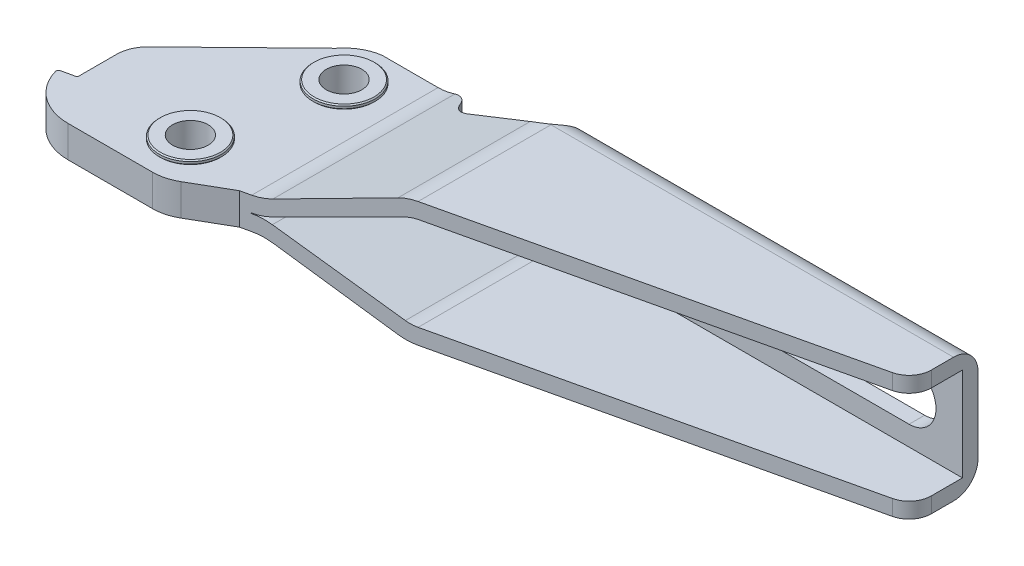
ISO-10303-21;
HEADER;
FILE_DESCRIPTION(('STEP AP214'),'2;1');
FILE_NAME('part.step','',(''),(''),'','','');
FILE_SCHEMA(('AUTOMOTIVE_DESIGN { 1 0 10303 214 1 1 1 1 }'));
ENDSEC;
DATA;
#1=APPLICATION_CONTEXT('core data for automotive mechanical design processes');
#2=APPLICATION_PROTOCOL_DEFINITION('international standard','automotive_design',2000,#1);
#3=PRODUCT_CONTEXT('',#1,'mechanical');
#4=PRODUCT('Part','Part','',(#3));
#5=PRODUCT_RELATED_PRODUCT_CATEGORY('part','',(#4));
#6=PRODUCT_DEFINITION_FORMATION('','',#4);
#7=PRODUCT_DEFINITION_CONTEXT('part definition',#1,'design');
#8=PRODUCT_DEFINITION('design','',#6,#7);
#9=PRODUCT_DEFINITION_SHAPE('','',#8);
#10=(LENGTH_UNIT() NAMED_UNIT(*) SI_UNIT(.MILLI.,.METRE.));
#11=(NAMED_UNIT(*) PLANE_ANGLE_UNIT() SI_UNIT($,.RADIAN.));
#12=(NAMED_UNIT(*) SI_UNIT($,.STERADIAN.) SOLID_ANGLE_UNIT());
#13=UNCERTAINTY_MEASURE_WITH_UNIT(LENGTH_MEASURE(1.E-05),#10,'distance_accuracy_value','');
#14=(GEOMETRIC_REPRESENTATION_CONTEXT(3) GLOBAL_UNCERTAINTY_ASSIGNED_CONTEXT((#13)) GLOBAL_UNIT_ASSIGNED_CONTEXT((#10,
#11,#12)) REPRESENTATION_CONTEXT('',''));
#15=CARTESIAN_POINT('',(0.,0.,0.));
#16=DIRECTION('',(0.,0.,1.));
#17=DIRECTION('',(1.,0.,0.));
#18=AXIS2_PLACEMENT_3D('',#15,#16,#17);
#19=CARTESIAN_POINT('',(0.,-3.55,0.));
#20=DIRECTION('',(0.,-1.,0.));
#21=DIRECTION('',(-0.7336112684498,0.,-0.67956935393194));
#22=AXIS2_PLACEMENT_3D('',#19,#20,#21);
#23=CONICAL_SURFACE('',#22,7.3,0.785398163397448);
#24=CARTESIAN_POINT('',(0.,-3.75,0.));
#25=DIRECTION('',(0.,-1.,0.));
#26=DIRECTION('',(-0.7336112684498,0.,-0.67956935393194));
#27=AXIS2_PLACEMENT_3D('',#24,#25,#26);
#28=CIRCLE('',#27,7.5);
#29=CARTESIAN_POINT('',(-5.5020845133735,-3.75,-5.09677015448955));
#30=VERTEX_POINT('',#29);
#31=EDGE_CURVE('E1063',#30,#30,#28,.T.);
#32=ORIENTED_EDGE('',*,*,#31,.F.);
#33=EDGE_LOOP('',(#32));
#34=FACE_BOUND('',#33,.T.);
#35=CARTESIAN_POINT('',(0.,-3.55,0.));
#36=DIRECTION('',(0.,-1.,0.));
#37=DIRECTION('',(0.,0.,1.));
#38=AXIS2_PLACEMENT_3D('',#35,#36,#37);
#39=CIRCLE('',#38,7.3);
#40=CARTESIAN_POINT('',(0.,-3.55,7.3));
#41=VERTEX_POINT('',#40);
#42=EDGE_CURVE('E1104',#41,#41,#39,.F.);
#43=ORIENTED_EDGE('',*,*,#42,.F.);
#44=EDGE_LOOP('',(#43));
#45=FACE_BOUND('',#44,.T.);
#46=ADVANCED_FACE('F14',(#34,#45),#23,.T.);
#47=CARTESIAN_POINT('',(0.,-3.55,0.));
#48=DIRECTION('',(0.,-1.,0.));
#49=DIRECTION('',(-0.7336112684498,0.,-0.67956935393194));
#50=AXIS2_PLACEMENT_3D('',#47,#48,#49);
#51=CYLINDRICAL_SURFACE('',#50,7.5);
#52=CARTESIAN_POINT('',(0.,-4.3,0.));
#53=DIRECTION('',(0.,1.,0.));
#54=DIRECTION('',(-1.,0.,0.));
#55=AXIS2_PLACEMENT_3D('',#52,#53,#54);
#56=CIRCLE('',#55,7.5);
#57=CARTESIAN_POINT('',(-7.5,-4.3,0.));
#58=VERTEX_POINT('',#57);
#59=EDGE_CURVE('E1078',#58,#58,#56,.T.);
#60=ORIENTED_EDGE('',*,*,#59,.T.);
#61=EDGE_LOOP('',(#60));
#62=FACE_BOUND('',#61,.T.);
#63=ORIENTED_EDGE('',*,*,#31,.T.);
#64=EDGE_LOOP('',(#63));
#65=FACE_BOUND('',#64,.T.);
#66=ADVANCED_FACE('F995',(#62,#65),#51,.T.);
#67=CARTESIAN_POINT('',(0.,3.55,0.));
#68=DIRECTION('',(0.,1.,0.));
#69=DIRECTION('',(0.7336112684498,0.,0.67956935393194));
#70=AXIS2_PLACEMENT_3D('',#67,#68,#69);
#71=CONICAL_SURFACE('',#70,6.75,0.785398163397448);
#72=CARTESIAN_POINT('',(0.,3.8,0.));
#73=DIRECTION('',(0.,1.,0.));
#74=DIRECTION('',(0.7336112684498,0.,0.67956935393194));
#75=AXIS2_PLACEMENT_3D('',#72,#73,#74);
#76=CIRCLE('',#75,7.);
#77=CARTESIAN_POINT('',(5.1352788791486,3.8,4.75698547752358));
#78=VERTEX_POINT('',#77);
#79=EDGE_CURVE('E1066',#78,#78,#76,.T.);
#80=ORIENTED_EDGE('',*,*,#79,.F.);
#81=EDGE_LOOP('',(#80));
#82=FACE_BOUND('',#81,.T.);
#83=CARTESIAN_POINT('',(0.,3.55,0.));
#84=DIRECTION('',(0.,1.,0.));
#85=DIRECTION('',(0.,0.,-1.));
#86=AXIS2_PLACEMENT_3D('',#83,#84,#85);
#87=CIRCLE('',#86,6.75);
#88=CARTESIAN_POINT('',(0.,3.55,-6.75));
#89=VERTEX_POINT('',#88);
#90=EDGE_CURVE('E1082',#89,#89,#87,.F.);
#91=ORIENTED_EDGE('',*,*,#90,.F.);
#92=EDGE_LOOP('',(#91));
#93=FACE_BOUND('',#92,.T.);
#94=ADVANCED_FACE('F1002',(#82,#93),#71,.T.);
#95=CARTESIAN_POINT('',(0.,-4.55,0.));
#96=DIRECTION('',(0.,1.,0.));
#97=DIRECTION('',(0.7336112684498,0.,0.67956935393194));
#98=AXIS2_PLACEMENT_3D('',#95,#96,#97);
#99=CYLINDRICAL_SURFACE('',#98,7.);
#100=CARTESIAN_POINT('',(0.,4.3,0.));
#101=DIRECTION('',(0.,-1.,0.));
#102=DIRECTION('',(1.,0.,0.));
#103=AXIS2_PLACEMENT_3D('',#100,#101,#102);
#104=CIRCLE('',#103,7.);
#105=CARTESIAN_POINT('',(7.,4.3,0.));
#106=VERTEX_POINT('',#105);
#107=EDGE_CURVE('E1047',#106,#106,#104,.T.);
#108=ORIENTED_EDGE('',*,*,#107,.T.);
#109=EDGE_LOOP('',(#108));
#110=FACE_BOUND('',#109,.T.);
#111=ORIENTED_EDGE('',*,*,#79,.T.);
#112=EDGE_LOOP('',(#111));
#113=FACE_BOUND('',#112,.T.);
#114=ADVANCED_FACE('F507',(#110,#113),#99,.T.);
#115=CARTESIAN_POINT('',(0.,-4.55,0.));
#116=DIRECTION('',(0.,1.,0.));
#117=DIRECTION('',(0.7336112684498,0.,0.67956935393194));
#118=AXIS2_PLACEMENT_3D('',#115,#116,#117);
#119=CYLINDRICAL_SURFACE('',#118,4.);
#120=CARTESIAN_POINT('',(0.,4.55,0.));
#121=DIRECTION('',(0.,-1.,0.));
#122=DIRECTION('',(1.,0.,0.));
#123=AXIS2_PLACEMENT_3D('',#120,#121,#122);
#124=CIRCLE('',#123,4.);
#125=CARTESIAN_POINT('',(4.,4.55,0.));
#126=VERTEX_POINT('',#125);
#127=EDGE_CURVE('E1074',#126,#126,#124,.F.);
#128=ORIENTED_EDGE('',*,*,#127,.T.);
#129=EDGE_LOOP('',(#128));
#130=FACE_BOUND('',#129,.T.);
#131=CARTESIAN_POINT('',(0.,-4.55,0.));
#132=DIRECTION('',(0.,1.,0.));
#133=DIRECTION('',(-1.,0.,0.));
#134=AXIS2_PLACEMENT_3D('',#131,#132,#133);
#135=CIRCLE('',#134,4.);
#136=CARTESIAN_POINT('',(-4.,-4.55,0.));
#137=VERTEX_POINT('',#136);
#138=EDGE_CURVE('E369',#137,#137,#135,.F.);
#139=ORIENTED_EDGE('',*,*,#138,.T.);
#140=EDGE_LOOP('',(#139));
#141=FACE_BOUND('',#140,.T.);
#142=ADVANCED_FACE('F1005',(#130,#141),#119,.F.);
#143=CARTESIAN_POINT('',(-6.48,-3.55,28.06));
#144=DIRECTION('',(0.,-1.,0.));
#145=DIRECTION('',(-0.7336112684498,0.,-0.67956935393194));
#146=AXIS2_PLACEMENT_3D('',#143,#144,#145);
#147=CONICAL_SURFACE('',#146,7.3,0.785398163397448);
#148=CARTESIAN_POINT('',(-6.48,-3.75,28.06));
#149=DIRECTION('',(0.,-1.,0.));
#150=DIRECTION('',(-0.7336112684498,0.,-0.67956935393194));
#151=AXIS2_PLACEMENT_3D('',#148,#149,#150);
#152=CIRCLE('',#151,7.5);
#153=CARTESIAN_POINT('',(-11.9820845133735,-3.75,22.9632298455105));
#154=VERTEX_POINT('',#153);
#155=EDGE_CURVE('E357',#154,#154,#152,.T.);
#156=ORIENTED_EDGE('',*,*,#155,.F.);
#157=EDGE_LOOP('',(#156));
#158=FACE_BOUND('',#157,.T.);
#159=CARTESIAN_POINT('',(-6.48,-3.55,28.06));
#160=DIRECTION('',(0.,-1.,0.));
#161=DIRECTION('',(0.,0.,1.));
#162=AXIS2_PLACEMENT_3D('',#159,#160,#161);
#163=CIRCLE('',#162,7.3);
#164=CARTESIAN_POINT('',(-6.48,-3.55,35.36));
#165=VERTEX_POINT('',#164);
#166=EDGE_CURVE('E1102',#165,#165,#163,.F.);
#167=ORIENTED_EDGE('',*,*,#166,.F.);
#168=EDGE_LOOP('',(#167));
#169=FACE_BOUND('',#168,.T.);
#170=ADVANCED_FACE('F1016',(#158,#169),#147,.T.);
#171=CARTESIAN_POINT('',(-6.48,-3.55,28.06));
#172=DIRECTION('',(0.,-1.,0.));
#173=DIRECTION('',(-0.7336112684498,0.,-0.67956935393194));
#174=AXIS2_PLACEMENT_3D('',#171,#172,#173);
#175=CYLINDRICAL_SURFACE('',#174,7.5);
#176=CARTESIAN_POINT('',(-6.48,-4.3,28.06));
#177=DIRECTION('',(0.,1.,0.));
#178=DIRECTION('',(-1.,0.,0.));
#179=AXIS2_PLACEMENT_3D('',#176,#177,#178);
#180=CIRCLE('',#179,7.5);
#181=CARTESIAN_POINT('',(-13.98,-4.3,28.06));
#182=VERTEX_POINT('',#181);
#183=EDGE_CURVE('E1053',#182,#182,#180,.T.);
#184=ORIENTED_EDGE('',*,*,#183,.T.);
#185=EDGE_LOOP('',(#184));
#186=FACE_BOUND('',#185,.T.);
#187=ORIENTED_EDGE('',*,*,#155,.T.);
#188=EDGE_LOOP('',(#187));
#189=FACE_BOUND('',#188,.T.);
#190=ADVANCED_FACE('F1019',(#186,#189),#175,.T.);
#191=CARTESIAN_POINT('',(-6.48,3.55,28.06));
#192=DIRECTION('',(0.,1.,0.));
#193=DIRECTION('',(0.7336112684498,0.,0.67956935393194));
#194=AXIS2_PLACEMENT_3D('',#191,#192,#193);
#195=CONICAL_SURFACE('',#194,6.75,0.785398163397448);
#196=CARTESIAN_POINT('',(-6.48,3.8,28.06));
#197=DIRECTION('',(0.,1.,0.));
#198=DIRECTION('',(0.7336112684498,0.,0.67956935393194));
#199=AXIS2_PLACEMENT_3D('',#196,#197,#198);
#200=CIRCLE('',#199,7.);
#201=CARTESIAN_POINT('',(-1.3447211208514,3.8,32.8169854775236));
#202=VERTEX_POINT('',#201);
#203=EDGE_CURVE('E1062',#202,#202,#200,.T.);
#204=ORIENTED_EDGE('',*,*,#203,.F.);
#205=EDGE_LOOP('',(#204));
#206=FACE_BOUND('',#205,.T.);
#207=CARTESIAN_POINT('',(-6.48,3.55,28.06));
#208=DIRECTION('',(0.,1.,0.));
#209=DIRECTION('',(0.,0.,-1.));
#210=AXIS2_PLACEMENT_3D('',#207,#208,#209);
#211=CIRCLE('',#210,6.75);
#212=CARTESIAN_POINT('',(-6.48,3.55,21.31));
#213=VERTEX_POINT('',#212);
#214=EDGE_CURVE('E1099',#213,#213,#211,.F.);
#215=ORIENTED_EDGE('',*,*,#214,.F.);
#216=EDGE_LOOP('',(#215));
#217=FACE_BOUND('',#216,.T.);
#218=ADVANCED_FACE('F1014',(#206,#217),#195,.T.);
#219=CARTESIAN_POINT('',(-6.48,-4.55,28.06));
#220=DIRECTION('',(0.,1.,0.));
#221=DIRECTION('',(0.7336112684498,0.,0.67956935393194));
#222=AXIS2_PLACEMENT_3D('',#219,#220,#221);
#223=CYLINDRICAL_SURFACE('',#222,7.);
#224=CARTESIAN_POINT('',(-6.48,4.3,28.06));
#225=DIRECTION('',(0.,-1.,0.));
#226=DIRECTION('',(1.,0.,0.));
#227=AXIS2_PLACEMENT_3D('',#224,#225,#226);
#228=CIRCLE('',#227,7.);
#229=CARTESIAN_POINT('',(0.52,4.3,28.06));
#230=VERTEX_POINT('',#229);
#231=EDGE_CURVE('E22',#230,#230,#228,.T.);
#232=ORIENTED_EDGE('',*,*,#231,.T.);
#233=EDGE_LOOP('',(#232));
#234=FACE_BOUND('',#233,.T.);
#235=ORIENTED_EDGE('',*,*,#203,.T.);
#236=EDGE_LOOP('',(#235));
#237=FACE_BOUND('',#236,.T.);
#238=ADVANCED_FACE('F1010',(#234,#237),#223,.T.);
#239=CARTESIAN_POINT('',(-6.48,-4.55,28.06));
#240=DIRECTION('',(0.,1.,0.));
#241=DIRECTION('',(0.7336112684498,0.,0.67956935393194));
#242=AXIS2_PLACEMENT_3D('',#239,#240,#241);
#243=CYLINDRICAL_SURFACE('',#242,4.);
#244=CARTESIAN_POINT('',(-6.48,4.55,28.06));
#245=DIRECTION('',(0.,-1.,0.));
#246=DIRECTION('',(1.,0.,0.));
#247=AXIS2_PLACEMENT_3D('',#244,#245,#246);
#248=CIRCLE('',#247,4.);
#249=CARTESIAN_POINT('',(-2.48,4.55,28.06));
#250=VERTEX_POINT('',#249);
#251=EDGE_CURVE('E1075',#250,#250,#248,.F.);
#252=ORIENTED_EDGE('',*,*,#251,.T.);
#253=EDGE_LOOP('',(#252));
#254=FACE_BOUND('',#253,.T.);
#255=CARTESIAN_POINT('',(-6.48,-4.55,28.06));
#256=DIRECTION('',(0.,1.,0.));
#257=DIRECTION('',(-1.,0.,0.));
#258=AXIS2_PLACEMENT_3D('',#255,#256,#257);
#259=CIRCLE('',#258,4.);
#260=CARTESIAN_POINT('',(-10.48,-4.55,28.06));
#261=VERTEX_POINT('',#260);
#262=EDGE_CURVE('E1069',#261,#261,#259,.F.);
#263=ORIENTED_EDGE('',*,*,#262,.T.);
#264=EDGE_LOOP('',(#263));
#265=FACE_BOUND('',#264,.T.);
#266=ADVANCED_FACE('F1013',(#254,#265),#243,.F.);
#267=CARTESIAN_POINT('',(56.,0.,-15.));
#268=DIRECTION('',(0.,0.,1.));
#269=DIRECTION('',(0.,1.,0.));
#270=AXIS2_PLACEMENT_3D('',#267,#268,#269);
#271=CYLINDRICAL_SURFACE('',#270,6.05);
#272=CARTESIAN_POINT('',(56.,0.,-10.5));
#273=DIRECTION('',(0.,0.,-1.));
#274=DIRECTION('',(0.,-1.,0.));
#275=AXIS2_PLACEMENT_3D('',#272,#273,#274);
#276=CIRCLE('',#275,6.05);
#277=CARTESIAN_POINT('',(56.,-6.05,-10.5));
#278=VERTEX_POINT('',#277);
#279=CARTESIAN_POINT('',(56.,6.05,-10.5));
#280=VERTEX_POINT('',#279);
#281=EDGE_CURVE('E348',#278,#280,#276,.T.);
#282=ORIENTED_EDGE('',*,*,#281,.T.);
#283=DIRECTION('',(0.,0.,1.));
#284=VECTOR('',#283,1.);
#285=CARTESIAN_POINT('',(56.,6.05,-15.));
#286=LINE('',#285,#284);
#287=CARTESIAN_POINT('',(56.,6.05,-7.));
#288=VERTEX_POINT('',#287);
#289=EDGE_CURVE('E375',#280,#288,#286,.T.);
#290=ORIENTED_EDGE('',*,*,#289,.T.);
#291=CARTESIAN_POINT('',(56.,0.,-7.));
#292=DIRECTION('',(0.,0.,1.));
#293=DIRECTION('',(1.,0.,0.));
#294=AXIS2_PLACEMENT_3D('',#291,#292,#293);
#295=CIRCLE('',#294,6.05);
#296=CARTESIAN_POINT('',(56.,-6.05,-7.));
#297=VERTEX_POINT('',#296);
#298=EDGE_CURVE('E366',#288,#297,#295,.T.);
#299=ORIENTED_EDGE('',*,*,#298,.T.);
#300=DIRECTION('',(0.,0.,1.));
#301=VECTOR('',#300,1.);
#302=CARTESIAN_POINT('',(56.,-6.05,-15.));
#303=LINE('',#302,#301);
#304=EDGE_CURVE('E29',#278,#297,#303,.T.);
#305=ORIENTED_EDGE('',*,*,#304,.F.);
#306=EDGE_LOOP('',(#282,#290,#299,#305));
#307=FACE_BOUND('',#306,.T.);
#308=ADVANCED_FACE('F1023',(#307),#271,.F.);
#309=CARTESIAN_POINT('',(120.,6.05,-15.));
#310=DIRECTION('',(0.,1.,0.));
#311=DIRECTION('',(-1.,0.,0.));
#312=AXIS2_PLACEMENT_3D('',#309,#310,#311);
#313=PLANE('',#312);
#314=DIRECTION('',(1.,0.,0.));
#315=VECTOR('',#314,1.);
#316=CARTESIAN_POINT('',(132.,6.05,-10.5));
#317=LINE('',#316,#315);
#318=CARTESIAN_POINT('',(120.,6.05,-10.5));
#319=VERTEX_POINT('',#318);
#320=EDGE_CURVE('E379',#280,#319,#317,.T.);
#321=ORIENTED_EDGE('',*,*,#320,.T.);
#322=DIRECTION('',(0.,0.,1.));
#323=VECTOR('',#322,1.);
#324=CARTESIAN_POINT('',(120.,6.05,-15.));
#325=LINE('',#324,#323);
#326=CARTESIAN_POINT('',(120.,6.05,-7.));
#327=VERTEX_POINT('',#326);
#328=EDGE_CURVE('E349',#319,#327,#325,.T.);
#329=ORIENTED_EDGE('',*,*,#328,.T.);
#330=DIRECTION('',(-1.,0.,0.));
#331=VECTOR('',#330,1.);
#332=CARTESIAN_POINT('',(120.,6.05,-7.));
#333=LINE('',#332,#331);
#334=EDGE_CURVE('E37',#327,#288,#333,.T.);
#335=ORIENTED_EDGE('',*,*,#334,.T.);
#336=ORIENTED_EDGE('',*,*,#289,.F.);
#337=EDGE_LOOP('',(#321,#329,#335,#336));
#338=FACE_BOUND('',#337,.T.);
#339=ADVANCED_FACE('F1116',(#338),#313,.F.);
#340=CARTESIAN_POINT('',(120.,0.,-15.));
#341=DIRECTION('',(0.,0.,1.));
#342=DIRECTION('',(0.,1.,0.));
#343=AXIS2_PLACEMENT_3D('',#340,#341,#342);
#344=CYLINDRICAL_SURFACE('',#343,6.05);
#345=CARTESIAN_POINT('',(120.,0.,-10.5));
#346=DIRECTION('',(0.,0.,-1.));
#347=DIRECTION('',(0.,-1.,0.));
#348=AXIS2_PLACEMENT_3D('',#345,#346,#347);
#349=CIRCLE('',#348,6.05);
#350=CARTESIAN_POINT('',(120.,-6.05,-10.5));
#351=VERTEX_POINT('',#350);
#352=EDGE_CURVE('E345',#319,#351,#349,.T.);
#353=ORIENTED_EDGE('',*,*,#352,.T.);
#354=DIRECTION('',(0.,0.,1.));
#355=VECTOR('',#354,1.);
#356=CARTESIAN_POINT('',(120.,-6.05,-15.));
#357=LINE('',#356,#355);
#358=CARTESIAN_POINT('',(120.,-6.05,-7.));
#359=VERTEX_POINT('',#358);
#360=EDGE_CURVE('E338',#351,#359,#357,.T.);
#361=ORIENTED_EDGE('',*,*,#360,.T.);
#362=CARTESIAN_POINT('',(120.,0.,-7.));
#363=DIRECTION('',(0.,0.,1.));
#364=DIRECTION('',(-1.,0.,0.));
#365=AXIS2_PLACEMENT_3D('',#362,#363,#364);
#366=CIRCLE('',#365,6.05);
#367=EDGE_CURVE('E343',#359,#327,#366,.T.);
#368=ORIENTED_EDGE('',*,*,#367,.T.);
#369=ORIENTED_EDGE('',*,*,#328,.F.);
#370=EDGE_LOOP('',(#353,#361,#368,#369));
#371=FACE_BOUND('',#370,.T.);
#372=ADVANCED_FACE('F340',(#371),#344,.F.);
#373=CARTESIAN_POINT('',(56.,-6.05,-15.));
#374=DIRECTION('',(0.,-1.,0.));
#375=DIRECTION('',(1.,0.,0.));
#376=AXIS2_PLACEMENT_3D('',#373,#374,#375);
#377=PLANE('',#376);
#378=DIRECTION('',(-1.,0.,0.));
#379=VECTOR('',#378,1.);
#380=CARTESIAN_POINT('',(132.,-6.05,-10.5));
#381=LINE('',#380,#379);
#382=EDGE_CURVE('E382',#351,#278,#381,.T.);
#383=ORIENTED_EDGE('',*,*,#382,.T.);
#384=ORIENTED_EDGE('',*,*,#304,.T.);
#385=DIRECTION('',(1.,0.,0.));
#386=VECTOR('',#385,1.);
#387=CARTESIAN_POINT('',(56.,-6.05,-7.));
#388=LINE('',#387,#386);
#389=EDGE_CURVE('E352',#297,#359,#388,.T.);
#390=ORIENTED_EDGE('',*,*,#389,.T.);
#391=ORIENTED_EDGE('',*,*,#360,.F.);
#392=EDGE_LOOP('',(#383,#384,#390,#391));
#393=FACE_BOUND('',#392,.T.);
#394=ADVANCED_FACE('F353',(#393),#377,.F.);
#395=CARTESIAN_POINT('',(132.,-8.5,-5.));
#396=DIRECTION('',(-1.,0.,0.));
#397=DIRECTION('',(0.,-1.,0.));
#398=AXIS2_PLACEMENT_3D('',#395,#396,#397);
#399=CYLINDRICAL_SURFACE('',#398,5.5);
#400=CARTESIAN_POINT('',(44.,-8.5,-5.));
#401=DIRECTION('',(-1.,0.,0.));
#402=DIRECTION('',(0.,-1.,0.));
#403=AXIS2_PLACEMENT_3D('',#400,#401,#402);
#404=CIRCLE('',#403,5.5);
#405=CARTESIAN_POINT('',(44.,-10.2916472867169,-10.2));
#406=VERTEX_POINT('',#405);
#407=CARTESIAN_POINT('',(44.,-8.5,-10.5));
#408=VERTEX_POINT('',#407);
#409=EDGE_CURVE('E798',#406,#408,#404,.F.);
#410=ORIENTED_EDGE('',*,*,#409,.T.);
#411=DIRECTION('',(-1.,0.,0.));
#412=VECTOR('',#411,1.);
#413=CARTESIAN_POINT('',(132.,-8.5,-10.5));
#414=LINE('',#413,#412);
#415=CARTESIAN_POINT('',(132.,-8.5,-10.5));
#416=VERTEX_POINT('',#415);
#417=EDGE_CURVE('E395',#416,#408,#414,.T.);
#418=ORIENTED_EDGE('',*,*,#417,.F.);
#419=CARTESIAN_POINT('',(132.,-8.5,-5.));
#420=DIRECTION('',(1.,0.,0.));
#421=DIRECTION('',(0.,0.,1.));
#422=AXIS2_PLACEMENT_3D('',#419,#420,#421);
#423=CIRCLE('',#422,5.5);
#424=CARTESIAN_POINT('',(132.,-14.,-5.));
#425=VERTEX_POINT('',#424);
#426=EDGE_CURVE('E384',#425,#416,#423,.T.);
#427=ORIENTED_EDGE('',*,*,#426,.F.);
#428=DIRECTION('',(-1.,0.,0.));
#429=VECTOR('',#428,1.);
#430=CARTESIAN_POINT('',(132.,-14.,-5.));
#431=LINE('',#430,#429);
#432=CARTESIAN_POINT('',(41.51,-14.,-5.));
#433=VERTEX_POINT('',#432);
#434=EDGE_CURVE('E398',#425,#433,#431,.T.);
#435=ORIENTED_EDGE('',*,*,#434,.T.);
#436=CARTESIAN_POINT('',(40.9459044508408,-13.9840771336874,-5.41820807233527));
#437=CARTESIAN_POINT('',(41.1285544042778,-13.9943901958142,-5.28284083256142));
#438=CARTESIAN_POINT('',(41.3112314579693,-13.9996935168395,-5.1474093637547));
#439=CARTESIAN_POINT('',(41.4992903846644,-13.9999957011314,-5.00794249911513));
#440=CARTESIAN_POINT('',(41.5046451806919,-14.0000000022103,-5.00397127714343));
#441=CARTESIAN_POINT('',(41.5099999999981,-14.,-5.));
#442=B_SPLINE_CURVE_WITH_KNOTS('',3,(#436,#437,#438,#439,#440,#441),.UNSPECIFIED.,.F.,.F.,(4,2,
4),(0.,0.682397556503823,0.702397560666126),.UNSPECIFIED.);
#443=CARTESIAN_POINT('',(41.351191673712,-13.9987389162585,-5.11777236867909));
#444=VERTEX_POINT('',#443);
#445=EDGE_CURVE('E435',#433,#444,#442,.F.);
#446=ORIENTED_EDGE('',*,*,#445,.T.);
#447=CARTESIAN_POINT('',(41.1763886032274,-14.,-5.));
#448=CARTESIAN_POINT('',(41.2973438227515,-13.9999932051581,-5.07851504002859));
#449=CARTESIAN_POINT('',(41.4155681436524,-13.9983182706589,-5.16129845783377));
#450=CARTESIAN_POINT('',(41.6459560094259,-13.9904853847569,-5.33488120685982));
#451=CARTESIAN_POINT('',(41.7581148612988,-13.9843240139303,-5.42568660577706));
#452=CARTESIAN_POINT('',(41.9761730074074,-13.9663195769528,-5.6151808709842));
#453=CARTESIAN_POINT('',(42.0820352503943,-13.9544460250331,-5.71390964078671));
#454=CARTESIAN_POINT('',(42.2860949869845,-13.9238332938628,-5.91797242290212));
#455=CARTESIAN_POINT('',(42.3842943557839,-13.9050958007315,-6.02330480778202));
#456=CARTESIAN_POINT('',(42.5729337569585,-13.8594975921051,-6.24021666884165));
#457=CARTESIAN_POINT('',(42.6633230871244,-13.8325882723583,-6.35183017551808));
#458=CARTESIAN_POINT('',(42.8350422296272,-13.7696674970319,-6.57941061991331));
#459=CARTESIAN_POINT('',(42.9163714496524,-13.7336554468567,-6.69537784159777));
#460=CARTESIAN_POINT('',(43.0692067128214,-13.651859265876,-6.92968551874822));
#461=CARTESIAN_POINT('',(43.1407462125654,-13.6061098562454,-7.04801622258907));
#462=CARTESIAN_POINT('',(43.274064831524,-13.5042288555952,-7.28569478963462));
#463=CARTESIAN_POINT('',(43.3358452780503,-13.4480986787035,-7.40504251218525));
#464=CARTESIAN_POINT('',(43.4435163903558,-13.331875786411,-7.63006489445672));
#465=CARTESIAN_POINT('',(43.4904024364,-13.2728650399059,-7.73582469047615));
#466=CARTESIAN_POINT('',(43.5766383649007,-13.1464687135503,-7.94538571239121));
#467=CARTESIAN_POINT('',(43.615988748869,-13.0790836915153,-8.04918706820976));
#468=CARTESIAN_POINT('',(43.6875848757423,-12.9361068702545,-8.25369633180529));
#469=CARTESIAN_POINT('',(43.7198234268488,-12.8605068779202,-8.35440102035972));
#470=CARTESIAN_POINT('',(43.7777035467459,-12.7015475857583,-8.55148222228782));
#471=CARTESIAN_POINT('',(43.803345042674,-12.6181882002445,-8.64785868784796));
#472=CARTESIAN_POINT('',(43.8481303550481,-12.4464382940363,-8.83290397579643));
#473=CARTESIAN_POINT('',(43.8674233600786,-12.3582305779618,-8.92170676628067));
#474=CARTESIAN_POINT('',(43.9010980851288,-12.1754236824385,-9.09353206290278));
#475=CARTESIAN_POINT('',(43.9154779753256,-12.0808221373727,-9.17655240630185));
#476=CARTESIAN_POINT('',(43.9400521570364,-11.8858340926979,-9.33612643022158));
#477=CARTESIAN_POINT('',(43.9502472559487,-11.7854487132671,-9.41268135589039));
#478=CARTESIAN_POINT('',(43.9671968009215,-11.5794499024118,-9.55883276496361));
#479=CARTESIAN_POINT('',(43.9739503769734,-11.4738351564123,-9.62842748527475));
#480=CARTESIAN_POINT('',(43.9878036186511,-11.1965800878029,-9.79768051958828));
#481=CARTESIAN_POINT('',(43.992921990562,-11.0215037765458,-9.89196866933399));
#482=CARTESIAN_POINT('',(43.9974906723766,-10.7523041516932,-10.0186614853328));
#483=CARTESIAN_POINT('',(43.9984959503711,-10.6615651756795,-10.0584042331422));
#484=CARTESIAN_POINT('',(43.9997483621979,-10.4780650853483,-10.1329382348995));
#485=CARTESIAN_POINT('',(43.9999954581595,-10.3853038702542,-10.1677292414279));
#486=CARTESIAN_POINT('',(44.,-10.2916472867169,-10.2));
#487=B_SPLINE_CURVE_WITH_KNOTS('',3,(#447,#448,#449,#450,#451,#452,#453,#454,#455,#456,#457,
#458,#459,#460,#461,#462,#463,#464,#465,#466,#467,#468,#469,#470,#471,#472,#473,#474,#475,#476,
#477,#478,#479,#480,#481,#482,#483,#484,#485,#486),.UNSPECIFIED.,.F.,.F.,(4,2,2,2,2,2,2,2,2,2,2,
2,2,2,2,2,2,2,2,4),(0.,0.432565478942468,0.865460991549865,1.30069292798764,1.73581802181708,
2.17358359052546,2.61137776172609,3.04763625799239,3.48383536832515,3.87294362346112,
4.26202597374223,4.65149999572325,5.04097831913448,5.42051210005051,5.8001870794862,
6.17978877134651,6.5594863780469,7.15480074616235,7.45187862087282,7.74897133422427),.UNSPECIFIED.);
#488=EDGE_CURVE('E797',#444,#406,#487,.T.);
#489=ORIENTED_EDGE('',*,*,#488,.T.);
#490=EDGE_LOOP('',(#410,#418,#427,#435,#446,#489));
#491=FACE_BOUND('',#490,.T.);
#492=ADVANCED_FACE('F420',(#491),#399,.T.);
#493=CARTESIAN_POINT('',(132.,8.5,-5.));
#494=DIRECTION('',(-1.,0.,0.));
#495=DIRECTION('',(0.,-1.,0.));
#496=AXIS2_PLACEMENT_3D('',#493,#494,#495);
#497=CYLINDRICAL_SURFACE('',#496,5.5);
#498=CARTESIAN_POINT('',(44.,8.5,-5.));
#499=DIRECTION('',(-1.,0.,0.));
#500=DIRECTION('',(0.,-1.,0.));
#501=AXIS2_PLACEMENT_3D('',#498,#499,#500);
#502=CIRCLE('',#501,5.5);
#503=CARTESIAN_POINT('',(44.,8.5,-10.5));
#504=VERTEX_POINT('',#503);
#505=CARTESIAN_POINT('',(44.,10.2916472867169,-10.2));
#506=VERTEX_POINT('',#505);
#507=EDGE_CURVE('E408',#504,#506,#502,.F.);
#508=ORIENTED_EDGE('',*,*,#507,.T.);
#509=CARTESIAN_POINT('',(44.,10.2916472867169,-10.2));
#510=CARTESIAN_POINT('',(43.9999776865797,10.4288697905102,-10.1527363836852));
#511=CARTESIAN_POINT('',(43.9994590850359,10.564220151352,-10.1000101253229));
#512=CARTESIAN_POINT('',(43.9965146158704,10.8303568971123,-9.98402143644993));
#513=CARTESIAN_POINT('',(43.9940881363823,10.9611418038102,-9.9207556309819));
#514=CARTESIAN_POINT('',(43.9863952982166,11.2177980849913,-9.78380938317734));
#515=CARTESIAN_POINT('',(43.9811165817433,11.3436455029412,-9.71008465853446));
#516=CARTESIAN_POINT('',(43.9666527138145,11.5889256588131,-9.55299255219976));
#517=CARTESIAN_POINT('',(43.957467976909,11.7083590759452,-9.46962619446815));
#518=CARTESIAN_POINT('',(43.934035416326,11.9403563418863,-9.29362568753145));
#519=CARTESIAN_POINT('',(43.9197695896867,12.0528940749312,-9.20095943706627));
#520=CARTESIAN_POINT('',(43.8850337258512,12.2697363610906,-9.00751688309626));
#521=CARTESIAN_POINT('',(43.8645644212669,12.3740418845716,-8.90674153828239));
#522=CARTESIAN_POINT('',(43.8163758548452,12.5733391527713,-8.69846291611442));
#523=CARTESIAN_POINT('',(43.7886752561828,12.6683540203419,-8.59097749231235));
#524=CARTESIAN_POINT('',(43.7250140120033,12.8486282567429,-8.37041697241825));
#525=CARTESIAN_POINT('',(43.6890543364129,12.9338887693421,-8.25734253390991));
#526=CARTESIAN_POINT('',(43.6112991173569,13.0877325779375,-8.03634248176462));
#527=CARTESIAN_POINT('',(43.5701936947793,13.1571025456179,-7.928720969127));
#528=CARTESIAN_POINT('',(43.4798829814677,13.2868479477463,-7.71147398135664));
#529=CARTESIAN_POINT('',(43.4306781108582,13.3472238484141,-7.60184861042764));
#530=CARTESIAN_POINT('',(43.323947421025,13.4589433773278,-7.38203384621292));
#531=CARTESIAN_POINT('',(43.2664207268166,13.5102860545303,-7.27184439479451));
#532=CARTESIAN_POINT('',(43.1430541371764,13.6041209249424,-7.05236321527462));
#533=CARTESIAN_POINT('',(43.0772144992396,13.646613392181,-6.94307145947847));
#534=CARTESIAN_POINT('',(42.9423114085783,13.720493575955,-6.734312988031));
#535=CARTESIAN_POINT('',(42.8737938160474,13.7524494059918,-6.6346929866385));
#536=CARTESIAN_POINT('',(42.7300067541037,13.8095707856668,-6.43837217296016));
#537=CARTESIAN_POINT('',(42.6547347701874,13.8347337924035,-6.3416724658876));
#538=CARTESIAN_POINT('',(42.4977939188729,13.8788715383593,-6.15205182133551));
#539=CARTESIAN_POINT('',(42.4161218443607,13.897843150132,-6.05913281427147));
#540=CARTESIAN_POINT('',(42.2468382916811,13.9302739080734,-5.87784446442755));
#541=CARTESIAN_POINT('',(42.1592252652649,13.9437316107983,-5.78947631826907));
#542=CARTESIAN_POINT('',(41.9314334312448,13.9716285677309,-5.57321844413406));
#543=CARTESIAN_POINT('',(41.7876280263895,13.9829335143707,-5.44869539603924));
#544=CARTESIAN_POINT('',(41.5639698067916,13.9935663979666,-5.27237047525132));
#545=CARTESIAN_POINT('',(41.4882228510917,13.996057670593,-5.21542371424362));
#546=CARTESIAN_POINT('',(41.3341794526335,13.9992730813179,-5.10504728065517));
#547=CARTESIAN_POINT('',(41.2558832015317,13.9999973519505,-5.05161734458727));
#548=CARTESIAN_POINT('',(41.1763886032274,14.,-5.));
#549=B_SPLINE_CURVE_WITH_KNOTS('',3,(#509,#510,#511,#512,#513,#514,#515,#516,#517,#518,#519,
#520,#521,#522,#523,#524,#525,#526,#527,#528,#529,#530,#531,#532,#533,#534,#535,#536,#537,#538,
#539,#540,#541,#542,#543,#544,#545,#546,#547,#548),.UNSPECIFIED.,.F.,.F.,(4,2,2,2,2,2,2,2,2,2,2,
2,2,2,2,2,2,2,2,4),(0.,0.435301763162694,0.870743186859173,1.3080865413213,1.74538349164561,
2.18424551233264,2.62305572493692,3.060744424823,3.49838174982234,3.90126876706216,
4.30413489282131,4.70704340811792,5.10993944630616,5.48471124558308,5.85962314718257,
6.23472413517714,6.60992325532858,7.18039165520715,7.46469413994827,7.7489752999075),.UNSPECIFIED.);
#550=CARTESIAN_POINT('',(41.351191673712,13.9987389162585,-5.11777236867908));
#551=VERTEX_POINT('',#550);
#552=EDGE_CURVE('E400',#506,#551,#549,.T.);
#553=ORIENTED_EDGE('',*,*,#552,.T.);
#554=CARTESIAN_POINT('',(40.9459044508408,13.9840771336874,-5.41820807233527));
#555=CARTESIAN_POINT('',(41.1285544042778,13.9943901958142,-5.28284083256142));
#556=CARTESIAN_POINT('',(41.3112314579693,13.9996935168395,-5.1474093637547));
#557=CARTESIAN_POINT('',(41.4992903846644,13.9999957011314,-5.00794249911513));
#558=CARTESIAN_POINT('',(41.5046451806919,14.0000000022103,-5.00397127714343));
#559=CARTESIAN_POINT('',(41.5099999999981,14.,-5.));
#560=B_SPLINE_CURVE_WITH_KNOTS('',3,(#554,#555,#556,#557,#558,#559),.UNSPECIFIED.,.F.,.F.,(4,2,
4),(0.,0.682397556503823,0.702397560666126),.UNSPECIFIED.);
#561=CARTESIAN_POINT('',(41.5099999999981,14.,-5.));
#562=VERTEX_POINT('',#561);
#563=EDGE_CURVE('E427',#551,#562,#560,.T.);
#564=ORIENTED_EDGE('',*,*,#563,.T.);
#565=DIRECTION('',(-1.,0.,0.));
#566=VECTOR('',#565,1.);
#567=CARTESIAN_POINT('',(132.,14.,-5.));
#568=LINE('',#567,#566);
#569=CARTESIAN_POINT('',(132.,14.,-5.));
#570=VERTEX_POINT('',#569);
#571=EDGE_CURVE('E390',#570,#562,#568,.T.);
#572=ORIENTED_EDGE('',*,*,#571,.F.);
#573=CARTESIAN_POINT('',(132.,8.5,-5.));
#574=DIRECTION('',(1.,0.,0.));
#575=DIRECTION('',(0.,0.,1.));
#576=AXIS2_PLACEMENT_3D('',#573,#574,#575);
#577=CIRCLE('',#576,5.5);
#578=CARTESIAN_POINT('',(132.,8.5,-10.5));
#579=VERTEX_POINT('',#578);
#580=EDGE_CURVE('E387',#579,#570,#577,.T.);
#581=ORIENTED_EDGE('',*,*,#580,.F.);
#582=DIRECTION('',(-1.,0.,0.));
#583=VECTOR('',#582,1.);
#584=CARTESIAN_POINT('',(132.,8.5,-10.5));
#585=LINE('',#584,#583);
#586=EDGE_CURVE('E393',#579,#504,#585,.T.);
#587=ORIENTED_EDGE('',*,*,#586,.T.);
#588=EDGE_LOOP('',(#508,#553,#564,#572,#581,#587));
#589=FACE_BOUND('',#588,.T.);
#590=ADVANCED_FACE('F414',(#589),#497,.T.);
#591=CARTESIAN_POINT('',(41.5100000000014,3.99999999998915,-7.));
#592=DIRECTION('',(0.,0.,1.));
#593=DIRECTION('',(0.,1.,0.));
#594=AXIS2_PLACEMENT_3D('',#591,#592,#593);
#595=PLANE('',#594);
#596=DIRECTION('',(-0.933560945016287,-0.358418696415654,0.));
#597=VECTOR('',#596,1.);
#598=CARTESIAN_POINT('',(39.180278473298,10.068146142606,-7.));
#599=LINE('',#598,#597);
#600=CARTESIAN_POINT('',(19.1961524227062,2.39571249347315,-7.));
#601=VERTEX_POINT('',#600);
#602=CARTESIAN_POINT('',(14.903396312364,0.747610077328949,-7.));
#603=VERTEX_POINT('',#602);
#604=EDGE_CURVE('E812',#601,#603,#599,.T.);
#605=ORIENTED_EDGE('',*,*,#604,.T.);
#606=CARTESIAN_POINT('',(11.1400000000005,10.5499999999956,-7.));
#607=DIRECTION('',(0.,0.,-1.));
#608=DIRECTION('',(-1.,0.,0.));
#609=AXIS2_PLACEMENT_3D('',#606,#607,#608);
#610=CIRCLE('',#609,10.4999999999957);
#611=CARTESIAN_POINT('',(10.995089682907,0.0509999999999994,-7.));
#612=VERTEX_POINT('',#611);
#613=EDGE_CURVE('E816',#603,#612,#610,.T.);
#614=ORIENTED_EDGE('',*,*,#613,.T.);
#615=DIRECTION('',(0.,-1.,0.));
#616=VECTOR('',#615,1.);
#617=CARTESIAN_POINT('',(10.995089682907,0.0509999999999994,-7.));
#618=LINE('',#617,#616);
#619=CARTESIAN_POINT('',(10.995089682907,-0.0510000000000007,-7.));
#620=VERTEX_POINT('',#619);
#621=EDGE_CURVE('E820',#612,#620,#618,.T.);
#622=ORIENTED_EDGE('',*,*,#621,.T.);
#623=CARTESIAN_POINT('',(11.1400000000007,-10.5499999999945,-7.));
#624=DIRECTION('',(0.,0.,-1.));
#625=DIRECTION('',(-1.,0.,0.));
#626=AXIS2_PLACEMENT_3D('',#623,#624,#625);
#627=CIRCLE('',#626,10.4999999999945);
#628=CARTESIAN_POINT('',(14.903396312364,-0.747610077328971,-7.));
#629=VERTEX_POINT('',#628);
#630=EDGE_CURVE('E824',#620,#629,#627,.T.);
#631=ORIENTED_EDGE('',*,*,#630,.T.);
#632=DIRECTION('',(0.933560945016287,-0.358418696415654,0.));
#633=VECTOR('',#632,1.);
#634=CARTESIAN_POINT('',(14.903396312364,-0.747610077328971,-7.));
#635=LINE('',#634,#633);
#636=CARTESIAN_POINT('',(19.1961524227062,-2.39571249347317,-7.));
#637=VERTEX_POINT('',#636);
#638=EDGE_CURVE('E828',#629,#637,#635,.T.);
#639=ORIENTED_EDGE('',*,*,#638,.T.);
#640=DIRECTION('',(0.,1.,0.));
#641=VECTOR('',#640,1.);
#642=CARTESIAN_POINT('',(19.1961524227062,-14.,-7.));
#643=LINE('',#642,#641);
#644=EDGE_CURVE('E711',#601,#637,#643,.F.);
#645=ORIENTED_EDGE('',*,*,#644,.F.);
#646=EDGE_LOOP('',(#605,#614,#622,#631,#639,#645));
#647=FACE_BOUND('',#646,.T.);
#648=ADVANCED_FACE('F419',(#647),#595,.T.);
#649=CARTESIAN_POINT('',(41.5100000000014,-3.99999999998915,41.56));
#650=DIRECTION('',(0.,0.,-1.));
#651=DIRECTION('',(0.,-1.,0.));
#652=AXIS2_PLACEMENT_3D('',#649,#650,#651);
#653=CYLINDRICAL_SURFACE('',#652,6.50000000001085);
#654=DIRECTION('',(0.,0.,-1.));
#655=VECTOR('',#654,1.);
#656=CARTESIAN_POINT('',(39.180278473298,-10.068146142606,41.56));
#657=LINE('',#656,#655);
#658=CARTESIAN_POINT('',(39.180278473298,-10.068146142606,25.4063007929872));
#659=VERTEX_POINT('',#658);
#660=CARTESIAN_POINT('',(39.180278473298,-10.068146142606,-4.15559503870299));
#661=VERTEX_POINT('',#660);
#662=EDGE_CURVE('E837',#659,#661,#657,.T.);
#663=ORIENTED_EDGE('',*,*,#662,.F.);
#664=CARTESIAN_POINT('',(41.5100000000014,-3.99999999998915,24.8684421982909));
#665=DIRECTION('',(0.224951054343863,0.,0.974370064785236));
#666=DIRECTION('',(0.974370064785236,0.,-0.224951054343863));
#667=AXIS2_PLACEMENT_3D('',#664,#665,#666);
#668=ELLIPSE('',#667,6.67097670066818,6.50000000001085);
#669=CARTESIAN_POINT('',(41.51,-10.5,24.8684421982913));
#670=VERTEX_POINT('',#669);
#671=EDGE_CURVE('E652',#670,#659,#668,.F.);
#672=ORIENTED_EDGE('',*,*,#671,.F.);
#673=DIRECTION('',(0.,0.,-1.));
#674=VECTOR('',#673,1.);
#675=CARTESIAN_POINT('',(41.51,-10.5,41.56));
#676=LINE('',#675,#674);
#677=CARTESIAN_POINT('',(41.51,-10.5,-5.23251572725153));
#678=VERTEX_POINT('',#677);
#679=EDGE_CURVE('E831',#670,#678,#676,.T.);
#680=ORIENTED_EDGE('',*,*,#679,.T.);
#681=CARTESIAN_POINT('',(39.180278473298,-10.068146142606,-4.15559503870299));
#682=CARTESIAN_POINT('',(39.3060614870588,-10.1164725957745,-4.18428425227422));
#683=CARTESIAN_POINT('',(39.4325020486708,-10.160494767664,-4.21732143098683));
#684=CARTESIAN_POINT('',(39.6854395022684,-10.2400673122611,-4.29217448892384));
#685=CARTESIAN_POINT('',(39.8119363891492,-10.2756183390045,-4.33398968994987));
#686=CARTESIAN_POINT('',(40.0609280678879,-10.3376899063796,-4.42545030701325));
#687=CARTESIAN_POINT('',(40.1834490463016,-10.3643948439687,-4.47489940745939));
#688=CARTESIAN_POINT('',(40.4261909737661,-10.4101957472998,-4.58210685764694));
#689=CARTESIAN_POINT('',(40.5464126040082,-10.4292940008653,-4.63986270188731));
#690=CARTESIAN_POINT('',(40.8109510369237,-10.463975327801,-4.77771027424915));
#691=CARTESIAN_POINT('',(40.9544350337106,-10.477733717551,-4.85988193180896));
#692=CARTESIAN_POINT('',(41.1656314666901,-10.4912631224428,-4.99235341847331));
#693=CARTESIAN_POINT('',(41.2358432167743,-10.4945858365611,-5.03840746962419));
#694=CARTESIAN_POINT('',(41.3743740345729,-10.498954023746,-5.13335445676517));
#695=CARTESIAN_POINT('',(41.4426934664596,-10.4999999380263,-5.18224684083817));
#696=CARTESIAN_POINT('',(41.51,-10.5,-5.23251572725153));
#697=B_SPLINE_CURVE_WITH_KNOTS('',3,(#681,#682,#683,#684,#685,#686,#687,#688,#689,#690,#691,
#692,#693,#694,#695,#696),.UNSPECIFIED.,.F.,.F.,(4,2,2,2,2,2,2,4),(0.,0.413162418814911,
0.826292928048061,1.23017197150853,1.63392945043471,2.13074449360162,2.38276270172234,
2.63473206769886),.UNSPECIFIED.);
#698=EDGE_CURVE('E717',#661,#678,#697,.T.);
#699=ORIENTED_EDGE('',*,*,#698,.F.);
#700=EDGE_LOOP('',(#663,#672,#680,#699));
#701=FACE_BOUND('',#700,.T.);
#702=ADVANCED_FACE('F727',(#701),#653,.F.);
#703=CARTESIAN_POINT('',(14.903396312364,-0.747610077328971,41.56));
#704=DIRECTION('',(0.358418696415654,0.933560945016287,0.));
#705=DIRECTION('',(-0.933560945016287,0.358418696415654,0.));
#706=AXIS2_PLACEMENT_3D('',#703,#704,#705);
#707=PLANE('',#706);
#708=DIRECTION('',(0.933560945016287,-0.358418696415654,0.));
#709=VECTOR('',#708,1.);
#710=CARTESIAN_POINT('',(39.2929367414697,-10.1113986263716,-4.));
#711=LINE('',#710,#709);
#712=CARTESIAN_POINT('',(23.797958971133,-4.16246753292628,-4.));
#713=VERTEX_POINT('',#712);
#714=CARTESIAN_POINT('',(37.8,-9.53822079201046,-4.));
#715=VERTEX_POINT('',#714);
#716=EDGE_CURVE('E860',#713,#715,#711,.T.);
#717=ORIENTED_EDGE('',*,*,#716,.F.);
#718=CARTESIAN_POINT('',(23.7979589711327,-4.16246753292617,-9.0000000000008));
#719=DIRECTION('',(0.358418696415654,0.933560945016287,0.));
#720=DIRECTION('',(-0.933560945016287,0.358418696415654,0.));
#721=AXIS2_PLACEMENT_3D('',#718,#719,#720);
#722=ELLIPSE('',#721,5.35583673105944,5.0000000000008);
#723=CARTESIAN_POINT('',(19.344341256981,-2.45260609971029,-6.7272727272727));
#724=VERTEX_POINT('',#723);
#725=EDGE_CURVE('E865',#724,#713,#722,.T.);
#726=ORIENTED_EDGE('',*,*,#725,.F.);
#727=CARTESIAN_POINT('',(14.0000000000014,-0.400772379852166,-4.00000000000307));
#728=DIRECTION('',(0.358418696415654,0.933560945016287,0.));
#729=DIRECTION('',(-0.933560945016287,0.358418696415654,0.));
#730=AXIS2_PLACEMENT_3D('',#727,#728,#729);
#731=ELLIPSE('',#730,6.42700407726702,5.99999999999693);
#732=EDGE_CURVE('E725',#637,#724,#731,.F.);
#733=ORIENTED_EDGE('',*,*,#732,.F.);
#734=ORIENTED_EDGE('',*,*,#638,.F.);
#735=DIRECTION('',(0.,0.,-1.));
#736=VECTOR('',#735,1.);
#737=CARTESIAN_POINT('',(14.903396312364,-0.747610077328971,41.56));
#738=LINE('',#737,#736);
#739=CARTESIAN_POINT('',(14.903396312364,-0.747610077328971,31.0110606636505));
#740=VERTEX_POINT('',#739);
#741=EDGE_CURVE('E840',#740,#629,#738,.T.);
#742=ORIENTED_EDGE('',*,*,#741,.F.);
#743=DIRECTION('',(-0.912604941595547,0.350373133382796,0.210691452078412));
#744=VECTOR('',#743,1.);
#745=CARTESIAN_POINT('',(13.8365011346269,-0.338000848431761,31.2573728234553));
#746=LINE('',#745,#744);
#747=EDGE_CURVE('E655',#659,#740,#746,.T.);
#748=ORIENTED_EDGE('',*,*,#747,.F.);
#749=ORIENTED_EDGE('',*,*,#662,.T.);
#750=CARTESIAN_POINT('',(37.8000000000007,-9.53822079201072,-10.1999999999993));
#751=DIRECTION('',(0.358418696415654,0.933560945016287,0.));
#752=DIRECTION('',(-0.933560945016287,0.358418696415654,0.));
#753=AXIS2_PLACEMENT_3D('',#750,#751,#752);
#754=ELLIPSE('',#753,6.64123754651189,6.19999999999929);
#755=EDGE_CURVE('E856',#715,#661,#754,.T.);
#756=ORIENTED_EDGE('',*,*,#755,.F.);
#757=EDGE_LOOP('',(#717,#726,#733,#734,#742,#748,#749,#756));
#758=FACE_BOUND('',#757,.T.);
#759=ADVANCED_FACE('F731',(#758),#707,.T.);
#760=CARTESIAN_POINT('',(11.1400000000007,-10.5499999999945,41.56));
#761=DIRECTION('',(0.,0.,-1.));
#762=DIRECTION('',(0.,-1.,0.));
#763=AXIS2_PLACEMENT_3D('',#760,#761,#762);
#764=CYLINDRICAL_SURFACE('',#763,10.4999999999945);
#765=ORIENTED_EDGE('',*,*,#741,.T.);
#766=ORIENTED_EDGE('',*,*,#630,.F.);
#767=DIRECTION('',(0.,0.,-1.));
#768=VECTOR('',#767,1.);
#769=CARTESIAN_POINT('',(10.995089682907,-0.0510000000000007,41.56));
#770=LINE('',#769,#768);
#771=CARTESIAN_POINT('',(10.995089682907,-0.0510000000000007,31.9133643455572));
#772=VERTEX_POINT('',#771);
#773=EDGE_CURVE('E842',#772,#620,#770,.T.);
#774=ORIENTED_EDGE('',*,*,#773,.F.);
#775=CARTESIAN_POINT('',(11.1400000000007,-10.5499999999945,31.8799091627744));
#776=DIRECTION('',(0.224951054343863,0.,0.974370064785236));
#777=DIRECTION('',(0.974370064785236,0.,-0.224951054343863));
#778=AXIS2_PLACEMENT_3D('',#775,#776,#777);
#779=ELLIPSE('',#778,10.776193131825,10.4999999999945);
#780=EDGE_CURVE('E658',#740,#772,#779,.T.);
#781=ORIENTED_EDGE('',*,*,#780,.F.);
#782=EDGE_LOOP('',(#765,#766,#774,#781));
#783=FACE_BOUND('',#782,.T.);
#784=ADVANCED_FACE('F735',(#783),#764,.T.);
#785=CARTESIAN_POINT('',(10.995089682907,0.0509999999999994,41.56));
#786=DIRECTION('',(1.,0.,0.));
#787=DIRECTION('',(0.,1.,0.));
#788=AXIS2_PLACEMENT_3D('',#785,#786,#787);
#789=PLANE('',#788);
#790=ORIENTED_EDGE('',*,*,#773,.T.);
#791=ORIENTED_EDGE('',*,*,#621,.F.);
#792=DIRECTION('',(0.,0.,-1.));
#793=VECTOR('',#792,1.);
#794=CARTESIAN_POINT('',(10.995089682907,0.0509999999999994,41.56));
#795=LINE('',#794,#793);
#796=CARTESIAN_POINT('',(10.995089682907,0.0509999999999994,31.9133643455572));
#797=VERTEX_POINT('',#796);
#798=EDGE_CURVE('E692',#797,#612,#795,.T.);
#799=ORIENTED_EDGE('',*,*,#798,.F.);
#800=DIRECTION('',(0.,1.,0.));
#801=VECTOR('',#800,1.);
#802=CARTESIAN_POINT('',(10.995089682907,-14.,31.9133643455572));
#803=LINE('',#802,#801);
#804=EDGE_CURVE('E661',#772,#797,#803,.T.);
#805=ORIENTED_EDGE('',*,*,#804,.F.);
#806=EDGE_LOOP('',(#790,#791,#799,#805));
#807=FACE_BOUND('',#806,.T.);
#808=ADVANCED_FACE('F739',(#807),#789,.T.);
#809=CARTESIAN_POINT('',(11.1400000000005,10.5499999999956,41.56));
#810=DIRECTION('',(0.,0.,-1.));
#811=DIRECTION('',(0.,-1.,0.));
#812=AXIS2_PLACEMENT_3D('',#809,#810,#811);
#813=CYLINDRICAL_SURFACE('',#812,10.4999999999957);
#814=ORIENTED_EDGE('',*,*,#798,.T.);
#815=ORIENTED_EDGE('',*,*,#613,.F.);
#816=DIRECTION('',(0.,0.,-1.));
#817=VECTOR('',#816,1.);
#818=CARTESIAN_POINT('',(14.903396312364,0.747610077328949,41.56));
#819=LINE('',#818,#817);
#820=CARTESIAN_POINT('',(14.903396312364,0.747610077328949,31.0110606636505));
#821=VERTEX_POINT('',#820);
#822=EDGE_CURVE('E688',#821,#603,#819,.T.);
#823=ORIENTED_EDGE('',*,*,#822,.F.);
#824=CARTESIAN_POINT('',(11.1400000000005,10.5499999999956,31.8799091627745));
#825=DIRECTION('',(0.224951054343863,0.,0.974370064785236));
#826=DIRECTION('',(0.974370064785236,0.,-0.224951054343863));
#827=AXIS2_PLACEMENT_3D('',#824,#825,#826);
#828=ELLIPSE('',#827,10.7761931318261,10.4999999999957);
#829=EDGE_CURVE('E664',#797,#821,#828,.T.);
#830=ORIENTED_EDGE('',*,*,#829,.F.);
#831=EDGE_LOOP('',(#814,#815,#823,#830));
#832=FACE_BOUND('',#831,.T.);
#833=ADVANCED_FACE('F743',(#832),#813,.T.);
#834=CARTESIAN_POINT('',(39.180278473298,10.068146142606,41.56));
#835=DIRECTION('',(0.358418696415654,-0.933560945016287,0.));
#836=DIRECTION('',(0.933560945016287,0.358418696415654,0.));
#837=AXIS2_PLACEMENT_3D('',#834,#835,#836);
#838=PLANE('',#837);
#839=DIRECTION('',(0.,0.,-1.));
#840=VECTOR('',#839,1.);
#841=CARTESIAN_POINT('',(39.180278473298,10.068146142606,41.56));
#842=LINE('',#841,#840);
#843=CARTESIAN_POINT('',(39.180278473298,10.068146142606,25.4063007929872));
#844=VERTEX_POINT('',#843);
#845=CARTESIAN_POINT('',(39.180278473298,10.068146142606,-4.15559503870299));
#846=VERTEX_POINT('',#845);
#847=EDGE_CURVE('E679',#844,#846,#842,.T.);
#848=ORIENTED_EDGE('',*,*,#847,.F.);
#849=DIRECTION('',(0.912604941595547,0.350373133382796,-0.210691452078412));
#850=VECTOR('',#849,1.);
#851=CARTESIAN_POINT('',(4.88343805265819,-3.09931646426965,33.3243503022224));
#852=LINE('',#851,#850);
#853=EDGE_CURVE('E666',#821,#844,#852,.T.);
#854=ORIENTED_EDGE('',*,*,#853,.F.);
#855=ORIENTED_EDGE('',*,*,#822,.T.);
#856=ORIENTED_EDGE('',*,*,#604,.F.);
#857=CARTESIAN_POINT('',(14.0000000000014,0.400772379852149,-4.00000000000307));
#858=DIRECTION('',(0.358418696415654,-0.933560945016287,0.));
#859=DIRECTION('',(0.933560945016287,0.358418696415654,0.));
#860=AXIS2_PLACEMENT_3D('',#857,#858,#859);
#861=ELLIPSE('',#860,6.42700407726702,5.99999999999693);
#862=CARTESIAN_POINT('',(19.344341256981,2.45260609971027,-6.7272727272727));
#863=VERTEX_POINT('',#862);
#864=EDGE_CURVE('E859',#863,#601,#861,.F.);
#865=ORIENTED_EDGE('',*,*,#864,.F.);
#866=CARTESIAN_POINT('',(23.7979589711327,4.16246753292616,-9.0000000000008));
#867=DIRECTION('',(0.358418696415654,-0.933560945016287,0.));
#868=DIRECTION('',(0.933560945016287,0.358418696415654,0.));
#869=AXIS2_PLACEMENT_3D('',#866,#867,#868);
#870=ELLIPSE('',#869,5.35583673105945,5.0000000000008);
#871=CARTESIAN_POINT('',(23.797958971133,4.16246753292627,-4.));
#872=VERTEX_POINT('',#871);
#873=EDGE_CURVE('E863',#872,#863,#870,.T.);
#874=ORIENTED_EDGE('',*,*,#873,.F.);
#875=DIRECTION('',(-0.933560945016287,-0.358418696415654,0.));
#876=VECTOR('',#875,1.);
#877=CARTESIAN_POINT('',(29.9239772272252,6.51440769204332,-4.));
#878=LINE('',#877,#876);
#879=CARTESIAN_POINT('',(37.8,9.53822079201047,-4.));
#880=VERTEX_POINT('',#879);
#881=EDGE_CURVE('E869',#880,#872,#878,.T.);
#882=ORIENTED_EDGE('',*,*,#881,.F.);
#883=CARTESIAN_POINT('',(37.8000000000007,9.53822079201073,-10.1999999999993));
#884=DIRECTION('',(0.358418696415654,-0.933560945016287,0.));
#885=DIRECTION('',(0.933560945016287,0.358418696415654,0.));
#886=AXIS2_PLACEMENT_3D('',#883,#884,#885);
#887=ELLIPSE('',#886,6.64123754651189,6.19999999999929);
#888=EDGE_CURVE('E687',#846,#880,#887,.T.);
#889=ORIENTED_EDGE('',*,*,#888,.F.);
#890=EDGE_LOOP('',(#848,#854,#855,#856,#865,#874,#882,#889));
#891=FACE_BOUND('',#890,.T.);
#892=ADVANCED_FACE('F684',(#891),#838,.T.);
#893=CARTESIAN_POINT('',(41.5100000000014,3.99999999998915,41.56));
#894=DIRECTION('',(0.,0.,-1.));
#895=DIRECTION('',(0.,-1.,0.));
#896=AXIS2_PLACEMENT_3D('',#893,#894,#895);
#897=CYLINDRICAL_SURFACE('',#896,6.50000000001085);
#898=DIRECTION('',(0.,0.,-1.));
#899=VECTOR('',#898,1.);
#900=CARTESIAN_POINT('',(41.51,10.5,41.56));
#901=LINE('',#900,#899);
#902=CARTESIAN_POINT('',(41.51,10.5,24.8684421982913));
#903=VERTEX_POINT('',#902);
#904=CARTESIAN_POINT('',(41.51,10.5,-5.23251572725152));
#905=VERTEX_POINT('',#904);
#906=EDGE_CURVE('E682',#903,#905,#901,.T.);
#907=ORIENTED_EDGE('',*,*,#906,.F.);
#908=CARTESIAN_POINT('',(41.5100000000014,3.99999999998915,24.8684421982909));
#909=DIRECTION('',(0.224951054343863,0.,0.974370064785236));
#910=DIRECTION('',(0.974370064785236,0.,-0.224951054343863));
#911=AXIS2_PLACEMENT_3D('',#908,#909,#910);
#912=ELLIPSE('',#911,6.67097670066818,6.50000000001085);
#913=EDGE_CURVE('E436',#844,#903,#912,.F.);
#914=ORIENTED_EDGE('',*,*,#913,.F.);
#915=ORIENTED_EDGE('',*,*,#847,.T.);
#916=CARTESIAN_POINT('',(41.51,10.5,-5.23251572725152));
#917=CARTESIAN_POINT('',(41.3996121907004,10.5000151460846,-5.15004183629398));
#918=CARTESIAN_POINT('',(41.2864201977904,10.4971881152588,-5.07126622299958));
#919=CARTESIAN_POINT('',(41.055206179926,10.485100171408,-4.92150198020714));
#920=CARTESIAN_POINT('',(40.9371804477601,10.4758342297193,-4.85051948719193));
#921=CARTESIAN_POINT('',(40.7000162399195,10.4504128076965,-4.71840182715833));
#922=CARTESIAN_POINT('',(40.5809660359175,10.4344209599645,-4.65707747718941));
#923=CARTESIAN_POINT('',(40.3402360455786,10.3950391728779,-4.54270786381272));
#924=CARTESIAN_POINT('',(40.2185577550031,10.3716533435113,-4.48965802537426));
#925=CARTESIAN_POINT('',(39.9455236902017,10.3107966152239,-4.38081228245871));
#926=CARTESIAN_POINT('',(39.7937409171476,10.2713281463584,-4.32715975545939));
#927=CARTESIAN_POINT('',(39.5648182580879,10.2026413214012,-4.25593155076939));
#928=CARTESIAN_POINT('',(39.4877403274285,10.1779510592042,-4.23360350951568));
#929=CARTESIAN_POINT('',(39.333792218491,10.1254172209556,-4.19218553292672));
#930=CARTESIAN_POINT('',(39.2569220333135,10.0975737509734,-4.17309548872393));
#931=CARTESIAN_POINT('',(39.180278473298,10.068146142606,-4.15559503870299));
#932=B_SPLINE_CURVE_WITH_KNOTS('',3,(#916,#917,#918,#919,#920,#921,#922,#923,#924,#925,#926,
#927,#928,#929,#930,#931),.UNSPECIFIED.,.F.,.F.,(4,2,2,2,2,2,2,4),(0.,0.413327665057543,
0.826978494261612,1.23110000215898,1.63499727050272,2.13120389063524,2.38297761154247,
2.63474286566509),.UNSPECIFIED.);
#933=EDGE_CURVE('E754',#905,#846,#932,.T.);
#934=ORIENTED_EDGE('',*,*,#933,.F.);
#935=EDGE_LOOP('',(#907,#914,#915,#934));
#936=FACE_BOUND('',#935,.T.);
#937=ADVANCED_FACE('F678',(#936),#897,.F.);
#938=CARTESIAN_POINT('',(134.,10.5,41.56));
#939=DIRECTION('',(0.,-1.,0.));
#940=DIRECTION('',(1.,0.,0.));
#941=AXIS2_PLACEMENT_3D('',#938,#939,#940);
#942=PLANE('',#941);
#943=DIRECTION('',(-1.,0.,0.));
#944=VECTOR('',#943,1.);
#945=CARTESIAN_POINT('',(134.,10.5,-7.));
#946=LINE('',#945,#944);
#947=CARTESIAN_POINT('',(132.,10.5,-7.));
#948=VERTEX_POINT('',#947);
#949=CARTESIAN_POINT('',(43.110367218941,10.5,-7.));
#950=VERTEX_POINT('',#949);
#951=EDGE_CURVE('E808',#948,#950,#946,.T.);
#952=ORIENTED_EDGE('',*,*,#951,.F.);
#953=DIRECTION('',(0.,0.,-1.));
#954=VECTOR('',#953,1.);
#955=CARTESIAN_POINT('',(132.,10.5,0.));
#956=LINE('',#955,#954);
#957=CARTESIAN_POINT('',(132.,10.5,0.));
#958=VERTEX_POINT('',#957);
#959=EDGE_CURVE('E690',#958,#948,#956,.T.);
#960=ORIENTED_EDGE('',*,*,#959,.F.);
#961=CARTESIAN_POINT('',(126.999999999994,10.5,-4.80518402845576E-12));
#962=DIRECTION('',(0.,-1.,0.));
#963=DIRECTION('',(1.,0.,0.));
#964=AXIS2_PLACEMENT_3D('',#961,#962,#963);
#965=CIRCLE('',#964,5.00000000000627);
#966=CARTESIAN_POINT('',(128.12475527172,10.5,4.8718503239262));
#967=VERTEX_POINT('',#966);
#968=EDGE_CURVE('E643',#967,#958,#965,.F.);
#969=ORIENTED_EDGE('',*,*,#968,.F.);
#970=DIRECTION('',(0.974370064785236,0.,-0.224951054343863));
#971=VECTOR('',#970,1.);
#972=CARTESIAN_POINT('',(8.8567217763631,10.5,32.407045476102));
#973=LINE('',#972,#971);
#974=EDGE_CURVE('E672',#903,#967,#973,.T.);
#975=ORIENTED_EDGE('',*,*,#974,.F.);
#976=ORIENTED_EDGE('',*,*,#906,.T.);
#977=CARTESIAN_POINT('',(37.8000000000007,10.5,-10.1999999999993));
#978=DIRECTION('',(0.,-1.,0.));
#979=DIRECTION('',(1.,0.,0.));
#980=AXIS2_PLACEMENT_3D('',#977,#978,#979);
#981=CIRCLE('',#980,6.19999999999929);
#982=EDGE_CURVE('E699',#950,#905,#981,.T.);
#983=ORIENTED_EDGE('',*,*,#982,.F.);
#984=EDGE_LOOP('',(#952,#960,#969,#975,#976,#983));
#985=FACE_BOUND('',#984,.T.);
#986=ADVANCED_FACE('F752',(#985),#942,.T.);
#987=CARTESIAN_POINT('',(41.51,-10.5,41.56));
#988=DIRECTION('',(0.,1.,0.));
#989=DIRECTION('',(-1.,0.,0.));
#990=AXIS2_PLACEMENT_3D('',#987,#988,#989);
#991=PLANE('',#990);
#992=ORIENTED_EDGE('',*,*,#679,.F.);
#993=DIRECTION('',(-0.974370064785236,0.,0.224951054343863));
#994=VECTOR('',#993,1.);
#995=CARTESIAN_POINT('',(8.8567217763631,-10.5,32.407045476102));
#996=LINE('',#995,#994);
#997=CARTESIAN_POINT('',(128.12475527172,-10.5,4.8718503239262));
#998=VERTEX_POINT('',#997);
#999=EDGE_CURVE('E705',#998,#670,#996,.T.);
#1000=ORIENTED_EDGE('',*,*,#999,.F.);
#1001=CARTESIAN_POINT('',(126.999999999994,-10.5,-4.80518402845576E-12));
#1002=DIRECTION('',(0.,1.,0.));
#1003=DIRECTION('',(-1.,0.,0.));
#1004=AXIS2_PLACEMENT_3D('',#1001,#1002,#1003);
#1005=CIRCLE('',#1004,5.00000000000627);
#1006=CARTESIAN_POINT('',(132.,-10.5,0.));
#1007=VERTEX_POINT('',#1006);
#1008=EDGE_CURVE('E646',#1007,#998,#1005,.F.);
#1009=ORIENTED_EDGE('',*,*,#1008,.F.);
#1010=DIRECTION('',(0.,0.,1.));
#1011=VECTOR('',#1010,1.);
#1012=CARTESIAN_POINT('',(132.,-10.5,0.));
#1013=LINE('',#1012,#1011);
#1014=CARTESIAN_POINT('',(132.,-10.5,-7.));
#1015=VERTEX_POINT('',#1014);
#1016=EDGE_CURVE('E702',#1015,#1007,#1013,.T.);
#1017=ORIENTED_EDGE('',*,*,#1016,.F.);
#1018=DIRECTION('',(1.,0.,0.));
#1019=VECTOR('',#1018,1.);
#1020=CARTESIAN_POINT('',(41.51,-10.5,-7.));
#1021=LINE('',#1020,#1019);
#1022=CARTESIAN_POINT('',(43.110367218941,-10.5,-7.));
#1023=VERTEX_POINT('',#1022);
#1024=EDGE_CURVE('E801',#1023,#1015,#1021,.T.);
#1025=ORIENTED_EDGE('',*,*,#1024,.F.);
#1026=CARTESIAN_POINT('',(37.8000000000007,-10.5,-10.1999999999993));
#1027=DIRECTION('',(0.,1.,0.));
#1028=DIRECTION('',(-1.,0.,0.));
#1029=AXIS2_PLACEMENT_3D('',#1026,#1027,#1028);
#1030=CIRCLE('',#1029,6.19999999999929);
#1031=EDGE_CURVE('E708',#678,#1023,#1030,.T.);
#1032=ORIENTED_EDGE('',*,*,#1031,.F.);
#1033=EDGE_LOOP('',(#992,#1000,#1009,#1017,#1025,#1032));
#1034=FACE_BOUND('',#1033,.T.);
#1035=ADVANCED_FACE('F451',(#1034),#991,.T.);
#1036=ORIENTED_EDGE('',*,*,#389,.F.);
#1037=ORIENTED_EDGE('',*,*,#298,.F.);
#1038=ORIENTED_EDGE('',*,*,#334,.F.);
#1039=ORIENTED_EDGE('',*,*,#367,.F.);
#1040=EDGE_LOOP('',(#1036,#1037,#1038,#1039));
#1041=FACE_BOUND('',#1040,.T.);
#1042=ORIENTED_EDGE('',*,*,#1024,.T.);
#1043=DIRECTION('',(0.,-1.,0.));
#1044=VECTOR('',#1043,1.);
#1045=CARTESIAN_POINT('',(132.,-14.,-7.));
#1046=LINE('',#1045,#1044);
#1047=EDGE_CURVE('E649',#948,#1015,#1046,.T.);
#1048=ORIENTED_EDGE('',*,*,#1047,.F.);
#1049=ORIENTED_EDGE('',*,*,#951,.T.);
#1050=DIRECTION('',(0.,1.,0.));
#1051=VECTOR('',#1050,1.);
#1052=CARTESIAN_POINT('',(43.110367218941,-14.,-7.));
#1053=LINE('',#1052,#1051);
#1054=EDGE_CURVE('E714',#1023,#950,#1053,.T.);
#1055=ORIENTED_EDGE('',*,*,#1054,.F.);
#1056=EDGE_LOOP('',(#1042,#1048,#1049,#1055));
#1057=FACE_BOUND('',#1056,.T.);
#1058=ADVANCED_FACE('F359',(#1041,#1057),#595,.T.);
#1059=CARTESIAN_POINT('',(41.5099999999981,4.00000000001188,40.56));
#1060=DIRECTION('',(0.,0.,-1.));
#1061=DIRECTION('',(0.,-1.,0.));
#1062=AXIS2_PLACEMENT_3D('',#1059,#1060,#1061);
#1063=CYLINDRICAL_SURFACE('',#1062,9.99999999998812);
#1064=ORIENTED_EDGE('',*,*,#563,.F.);
#1065=CARTESIAN_POINT('',(37.837920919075,13.301388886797,-4.00011596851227));
#1066=CARTESIAN_POINT('',(37.9818223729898,13.3582298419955,-4.00097208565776));
#1067=CARTESIAN_POINT('',(38.1270626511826,13.4116792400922,-4.00689432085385));
#1068=CARTESIAN_POINT('',(38.419171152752,13.5115961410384,-4.02926155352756));
#1069=CARTESIAN_POINT('',(38.5660398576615,13.5580615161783,-4.0457097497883));
#1070=CARTESIAN_POINT('',(38.8602742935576,13.6437789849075,-4.08952051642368));
#1071=CARTESIAN_POINT('',(39.0076400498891,13.6830307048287,-4.11688365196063));
#1072=CARTESIAN_POINT('',(39.3016195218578,13.7542768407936,-4.18270674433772));
#1073=CARTESIAN_POINT('',(39.448233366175,13.7862725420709,-4.22116473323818));
#1074=CARTESIAN_POINT('',(39.7398123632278,13.8431983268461,-4.30929745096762));
#1075=CARTESIAN_POINT('',(39.8847731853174,13.8681127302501,-4.35899664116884));
#1076=CARTESIAN_POINT('',(40.1714829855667,13.9110738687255,-4.4694096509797));
#1077=CARTESIAN_POINT('',(40.3132319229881,13.9291205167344,-4.53012361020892));
#1078=CARTESIAN_POINT('',(40.5920357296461,13.9587629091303,-4.66210519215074));
#1079=CARTESIAN_POINT('',(40.7291000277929,13.9703724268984,-4.73334986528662));
#1080=CARTESIAN_POINT('',(40.9977365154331,13.9877769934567,-4.88602519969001));
#1081=CARTESIAN_POINT('',(41.1293117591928,13.9935753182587,-4.96745009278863));
#1082=CARTESIAN_POINT('',(41.3004694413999,13.9978965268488,-5.08244411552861));
#1083=CARTESIAN_POINT('',(41.3429195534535,13.9986927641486,-5.11174063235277));
#1084=CARTESIAN_POINT('',(41.4270393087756,13.9997441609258,-5.17135816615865));
#1085=CARTESIAN_POINT('',(41.4687096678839,13.9999998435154,-5.2016781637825));
#1086=CARTESIAN_POINT('',(41.51,14.,-5.23251572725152));
#1087=B_SPLINE_CURVE_WITH_KNOTS('',3,(#1065,#1066,#1067,#1068,#1069,#1070,#1071,#1072,#1073,
#1074,#1075,#1076,#1077,#1078,#1079,#1080,#1081,#1082,#1083,#1084,#1085,#1086),.UNSPECIFIED.,
.F.,.F.,(4,2,2,2,2,2,2,2,2,2,4),(0.,0.464086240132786,0.928313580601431,1.39256496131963,
1.8567340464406,2.32192307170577,2.78711799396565,3.25131366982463,3.71524751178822,
3.86998680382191,4.02457628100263),.UNSPECIFIED.);
#1088=CARTESIAN_POINT('',(37.837920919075,13.301388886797,-4.00011596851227));
#1089=VERTEX_POINT('',#1088);
#1090=EDGE_CURVE('E456',#1089,#551,#1087,.T.);
#1091=ORIENTED_EDGE('',*,*,#1090,.F.);
#1092=DIRECTION('',(0.,0.,-1.));
#1093=VECTOR('',#1092,1.);
#1094=CARTESIAN_POINT('',(37.837920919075,13.301388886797,40.56));
#1095=LINE('',#1094,#1093);
#1096=CARTESIAN_POINT('',(37.837920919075,13.301388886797,25.7162084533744));
#1097=VERTEX_POINT('',#1096);
#1098=EDGE_CURVE('E765',#1097,#1089,#1095,.T.);
#1099=ORIENTED_EDGE('',*,*,#1098,.F.);
#1100=CARTESIAN_POINT('',(41.5099999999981,4.00000000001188,24.8684421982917));
#1101=DIRECTION('',(0.224951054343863,0.,0.974370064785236));
#1102=DIRECTION('',(0.974370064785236,0.,-0.224951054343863));
#1103=AXIS2_PLACEMENT_3D('',#1100,#1101,#1102);
#1104=ELLIPSE('',#1103,10.2630410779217,9.99999999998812);
#1105=CARTESIAN_POINT('',(41.5099999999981,14.,24.8684421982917));
#1106=VERTEX_POINT('',#1105);
#1107=EDGE_CURVE('E465',#1106,#1097,#1104,.T.);
#1108=ORIENTED_EDGE('',*,*,#1107,.F.);
#1109=DIRECTION('',(0.,0.,-1.));
#1110=VECTOR('',#1109,1.);
#1111=CARTESIAN_POINT('',(41.51,14.,40.56));
#1112=LINE('',#1111,#1110);
#1113=EDGE_CURVE('E761',#1106,#562,#1112,.T.);
#1114=ORIENTED_EDGE('',*,*,#1113,.T.);
#1115=EDGE_LOOP('',(#1064,#1091,#1099,#1108,#1114));
#1116=FACE_BOUND('',#1115,.T.);
#1117=ADVANCED_FACE('F444',(#1116),#1063,.T.);
#1118=CARTESIAN_POINT('',(14.995683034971,4.283541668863,40.56));
#1119=DIRECTION('',(-0.367207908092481,0.93013888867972,0.));
#1120=DIRECTION('',(-0.93013888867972,-0.367207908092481,0.));
#1121=AXIS2_PLACEMENT_3D('',#1118,#1119,#1120);
#1122=PLANE('',#1121);
#1123=DIRECTION('',(0.93013888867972,0.367207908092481,0.));
#1124=VECTOR('',#1123,1.);
#1125=CARTESIAN_POINT('',(28.48020503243,9.60707256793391,-4.));
#1126=LINE('',#1125,#1124);
#1127=CARTESIAN_POINT('',(23.797958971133,7.75857681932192,-4.));
#1128=VERTEX_POINT('',#1127);
#1129=CARTESIAN_POINT('',(37.8,13.286418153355,-4.));
#1130=VERTEX_POINT('',#1129);
#1131=EDGE_CURVE('E472',#1128,#1130,#1126,.T.);
#1132=ORIENTED_EDGE('',*,*,#1131,.F.);
#1133=CARTESIAN_POINT('',(23.7979589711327,7.75857681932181,-9.0000000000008));
#1134=DIRECTION('',(-0.367207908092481,0.93013888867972,0.));
#1135=DIRECTION('',(0.93013888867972,0.367207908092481,0.));
#1136=AXIS2_PLACEMENT_3D('',#1133,#1134,#1135);
#1137=ELLIPSE('',#1136,5.3755412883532,5.0000000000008);
#1138=CARTESIAN_POINT('',(19.344341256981,6.00034085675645,-6.7272727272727));
#1139=VERTEX_POINT('',#1138);
#1140=EDGE_CURVE('E469',#1139,#1128,#1137,.T.);
#1141=ORIENTED_EDGE('',*,*,#1140,.F.);
#1142=CARTESIAN_POINT('',(14.0000000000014,3.89045770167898,-4.00000000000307));
#1143=DIRECTION('',(-0.367207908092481,0.93013888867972,0.));
#1144=DIRECTION('',(0.93013888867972,0.367207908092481,0.));
#1145=AXIS2_PLACEMENT_3D('',#1142,#1143,#1144);
#1146=ELLIPSE('',#1145,6.45064954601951,5.99999999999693);
#1147=CARTESIAN_POINT('',(14.995683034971,4.283541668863,-9.91680786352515));
#1148=VERTEX_POINT('',#1147);
#1149=EDGE_CURVE('E464',#1148,#1139,#1146,.F.);
#1150=ORIENTED_EDGE('',*,*,#1149,.F.);
#1151=DIRECTION('',(0.,0.,-1.));
#1152=VECTOR('',#1151,1.);
#1153=CARTESIAN_POINT('',(14.995683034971,4.283541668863,40.56));
#1154=LINE('',#1153,#1152);
#1155=CARTESIAN_POINT('',(14.995683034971,4.283541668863,30.9897545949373));
#1156=VERTEX_POINT('',#1155);
#1157=EDGE_CURVE('E768',#1156,#1148,#1154,.T.);
#1158=ORIENTED_EDGE('',*,*,#1157,.F.);
#1159=DIRECTION('',(-0.909407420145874,-0.359023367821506,0.209953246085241));
#1160=VECTOR('',#1159,1.);
#1161=CARTESIAN_POINT('',(3.67847104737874,-0.184360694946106,33.6025388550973));
#1162=LINE('',#1161,#1160);
#1163=EDGE_CURVE('E634',#1097,#1156,#1162,.T.);
#1164=ORIENTED_EDGE('',*,*,#1163,.F.);
#1165=ORIENTED_EDGE('',*,*,#1098,.T.);
#1166=CARTESIAN_POINT('',(37.8000000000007,13.2864181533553,-10.1999999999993));
#1167=DIRECTION('',(-0.367207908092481,0.93013888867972,0.));
#1168=DIRECTION('',(0.93013888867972,0.367207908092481,0.));
#1169=AXIS2_PLACEMENT_3D('',#1166,#1167,#1168);
#1170=ELLIPSE('',#1169,6.66567119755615,6.19999999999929);
#1171=EDGE_CURVE('E475',#1130,#1089,#1170,.T.);
#1172=ORIENTED_EDGE('',*,*,#1171,.F.);
#1173=EDGE_LOOP('',(#1132,#1141,#1150,#1158,#1164,#1165,#1172));
#1174=FACE_BOUND('',#1173,.T.);
#1175=ADVANCED_FACE('F449',(#1174),#1122,.T.);
#1176=CARTESIAN_POINT('',(11.1399999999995,14.0500000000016,40.56));
#1177=DIRECTION('',(0.,0.,-1.));
#1178=DIRECTION('',(0.,-1.,0.));
#1179=AXIS2_PLACEMENT_3D('',#1176,#1177,#1178);
#1180=CYLINDRICAL_SURFACE('',#1179,10.5000000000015);
#1181=CARTESIAN_POINT('',(11.1399999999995,14.0500000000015,-10.));
#1182=DIRECTION('',(0.,0.,-1.));
#1183=DIRECTION('',(0.,-1.,0.));
#1184=AXIS2_PLACEMENT_3D('',#1181,#1182,#1183);
#1185=CIRCLE('',#1184,10.5000000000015);
#1186=CARTESIAN_POINT('',(11.14,3.55,-10.));
#1187=VERTEX_POINT('',#1186);
#1188=CARTESIAN_POINT('',(14.,3.94701034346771,-10.));
#1189=VERTEX_POINT('',#1188);
#1190=EDGE_CURVE('E478',#1187,#1189,#1185,.F.);
#1191=ORIENTED_EDGE('',*,*,#1190,.F.);
#1192=DIRECTION('',(0.,0.,-1.));
#1193=VECTOR('',#1192,1.);
#1194=CARTESIAN_POINT('',(11.14,3.55,40.56));
#1195=LINE('',#1194,#1193);
#1196=CARTESIAN_POINT('',(11.14,3.55,31.8799091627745));
#1197=VERTEX_POINT('',#1196);
#1198=EDGE_CURVE('E770',#1197,#1187,#1195,.T.);
#1199=ORIENTED_EDGE('',*,*,#1198,.F.);
#1200=CARTESIAN_POINT('',(11.1399999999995,14.0500000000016,31.8799091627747));
#1201=DIRECTION('',(0.224951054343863,0.,0.974370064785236));
#1202=DIRECTION('',(0.974370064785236,0.,-0.224951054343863));
#1203=AXIS2_PLACEMENT_3D('',#1200,#1201,#1202);
#1204=ELLIPSE('',#1203,10.7761931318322,10.5000000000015);
#1205=EDGE_CURVE('E637',#1156,#1197,#1204,.F.);
#1206=ORIENTED_EDGE('',*,*,#1205,.F.);
#1207=ORIENTED_EDGE('',*,*,#1157,.T.);
#1208=CARTESIAN_POINT('',(14.,3.94701034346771,-10.));
#1209=CARTESIAN_POINT('',(14.0847510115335,3.97099942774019,-10.0000018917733));
#1210=CARTESIAN_POINT('',(14.1691951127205,3.99605870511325,-9.99820438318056));
#1211=CARTESIAN_POINT('',(14.3371142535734,4.04819219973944,-9.99110964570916));
#1212=CARTESIAN_POINT('',(14.4205909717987,4.07526201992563,-9.98581986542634));
#1213=CARTESIAN_POINT('',(14.5865802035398,4.13139316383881,-9.97183902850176));
#1214=CARTESIAN_POINT('',(14.6690927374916,4.16045444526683,-9.96314804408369));
#1215=CARTESIAN_POINT('',(14.8331781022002,4.22054953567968,-9.94244653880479));
#1216=CARTESIAN_POINT('',(14.9147485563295,4.25158741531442,-9.93042898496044));
#1217=CARTESIAN_POINT('',(14.995683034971,4.283541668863,-9.91680786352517));
#1218=B_SPLINE_CURVE_WITH_KNOTS('',3,(#1208,#1209,#1210,#1211,#1212,#1213,#1214,#1215,#1216,
#1217),.UNSPECIFIED.,.F.,.F.,(4,2,2,2,4),(0.,0.264211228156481,0.527860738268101,
0.791504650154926,1.05571026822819),.UNSPECIFIED.);
#1219=EDGE_CURVE('E481',#1189,#1148,#1218,.T.);
#1220=ORIENTED_EDGE('',*,*,#1219,.F.);
#1221=EDGE_LOOP('',(#1191,#1199,#1206,#1207,#1220));
#1222=FACE_BOUND('',#1221,.T.);
#1223=ADVANCED_FACE('F495',(#1222),#1180,.F.);
#1224=CARTESIAN_POINT('',(11.1399999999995,-14.0500000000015,40.56));
#1225=DIRECTION('',(0.,0.,-1.));
#1226=DIRECTION('',(0.,-1.,0.));
#1227=AXIS2_PLACEMENT_3D('',#1224,#1225,#1226);
#1228=CYLINDRICAL_SURFACE('',#1227,10.5000000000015);
#1229=DIRECTION('',(0.,0.,-1.));
#1230=VECTOR('',#1229,1.);
#1231=CARTESIAN_POINT('',(14.995683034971,-4.283541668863,40.56));
#1232=LINE('',#1231,#1230);
#1233=CARTESIAN_POINT('',(14.995683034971,-4.283541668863,30.9897545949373));
#1234=VERTEX_POINT('',#1233);
#1235=CARTESIAN_POINT('',(14.995683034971,-4.283541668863,-9.91680786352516));
#1236=VERTEX_POINT('',#1235);
#1237=EDGE_CURVE('E947',#1234,#1236,#1232,.T.);
#1238=ORIENTED_EDGE('',*,*,#1237,.F.);
#1239=CARTESIAN_POINT('',(11.1399999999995,-14.0500000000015,31.8799091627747));
#1240=DIRECTION('',(0.224951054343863,0.,0.974370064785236));
#1241=DIRECTION('',(0.974370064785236,0.,-0.224951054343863));
#1242=AXIS2_PLACEMENT_3D('',#1239,#1240,#1241);
#1243=ELLIPSE('',#1242,10.7761931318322,10.5000000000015);
#1244=CARTESIAN_POINT('',(11.14,-3.55,31.8799091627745));
#1245=VERTEX_POINT('',#1244);
#1246=EDGE_CURVE('E628',#1245,#1234,#1243,.F.);
#1247=ORIENTED_EDGE('',*,*,#1246,.F.);
#1248=DIRECTION('',(0.,0.,-1.));
#1249=VECTOR('',#1248,1.);
#1250=CARTESIAN_POINT('',(11.14,-3.55,40.56));
#1251=LINE('',#1250,#1249);
#1252=CARTESIAN_POINT('',(11.14,-3.55,-10.));
#1253=VERTEX_POINT('',#1252);
#1254=EDGE_CURVE('E942',#1245,#1253,#1251,.T.);
#1255=ORIENTED_EDGE('',*,*,#1254,.T.);
#1256=CARTESIAN_POINT('',(11.1399999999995,-14.0500000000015,-10.));
#1257=DIRECTION('',(0.,0.,-1.));
#1258=DIRECTION('',(0.,-1.,0.));
#1259=AXIS2_PLACEMENT_3D('',#1256,#1257,#1258);
#1260=CIRCLE('',#1259,10.5000000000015);
#1261=CARTESIAN_POINT('',(14.,-3.94701034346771,-10.));
#1262=VERTEX_POINT('',#1261);
#1263=EDGE_CURVE('E527',#1262,#1253,#1260,.F.);
#1264=ORIENTED_EDGE('',*,*,#1263,.F.);
#1265=CARTESIAN_POINT('',(14.995683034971,-4.283541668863,-9.91680786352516));
#1266=CARTESIAN_POINT('',(14.9147485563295,-4.25158741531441,-9.93042898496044));
#1267=CARTESIAN_POINT('',(14.8331781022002,-4.22054953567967,-9.94244653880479));
#1268=CARTESIAN_POINT('',(14.6690927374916,-4.16045444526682,-9.96314804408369));
#1269=CARTESIAN_POINT('',(14.5865802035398,-4.1313931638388,-9.97183902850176));
#1270=CARTESIAN_POINT('',(14.4205909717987,-4.07526201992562,-9.98581986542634));
#1271=CARTESIAN_POINT('',(14.3371142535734,-4.04819219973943,-9.99110964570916));
#1272=CARTESIAN_POINT('',(14.1691951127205,-3.99605870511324,-9.99820438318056));
#1273=CARTESIAN_POINT('',(14.0847510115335,-3.97099942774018,-10.0000018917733));
#1274=CARTESIAN_POINT('',(14.,-3.94701034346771,-10.));
#1275=B_SPLINE_CURVE_WITH_KNOTS('',3,(#1265,#1266,#1267,#1268,#1269,#1270,#1271,#1272,#1273,
#1274),.UNSPECIFIED.,.F.,.F.,(4,2,2,2,4),(0.,0.264205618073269,0.527849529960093,
0.791499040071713,1.0557102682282),.UNSPECIFIED.);
#1276=EDGE_CURVE('E518',#1236,#1262,#1275,.T.);
#1277=ORIENTED_EDGE('',*,*,#1276,.F.);
#1278=EDGE_LOOP('',(#1238,#1247,#1255,#1264,#1277));
#1279=FACE_BOUND('',#1278,.T.);
#1280=ADVANCED_FACE('F499',(#1279),#1228,.F.);
#1281=CARTESIAN_POINT('',(37.837920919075,-13.301388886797,40.56));
#1282=DIRECTION('',(-0.367207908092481,-0.93013888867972,0.));
#1283=DIRECTION('',(0.93013888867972,-0.367207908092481,0.));
#1284=AXIS2_PLACEMENT_3D('',#1281,#1282,#1283);
#1285=PLANE('',#1284);
#1286=DIRECTION('',(0.,0.,-1.));
#1287=VECTOR('',#1286,1.);
#1288=CARTESIAN_POINT('',(37.837920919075,-13.301388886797,40.56));
#1289=LINE('',#1288,#1287);
#1290=CARTESIAN_POINT('',(37.837920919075,-13.301388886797,25.7162084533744));
#1291=VERTEX_POINT('',#1290);
#1292=CARTESIAN_POINT('',(37.837920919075,-13.301388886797,-4.00011596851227));
#1293=VERTEX_POINT('',#1292);
#1294=EDGE_CURVE('E961',#1291,#1293,#1289,.T.);
#1295=ORIENTED_EDGE('',*,*,#1294,.F.);
#1296=DIRECTION('',(0.909407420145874,-0.359023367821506,-0.209953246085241));
#1297=VECTOR('',#1296,1.);
#1298=CARTESIAN_POINT('',(12.8204294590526,-3.42477710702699,31.491951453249));
#1299=LINE('',#1298,#1297);
#1300=EDGE_CURVE('E631',#1234,#1291,#1299,.T.);
#1301=ORIENTED_EDGE('',*,*,#1300,.F.);
#1302=ORIENTED_EDGE('',*,*,#1237,.T.);
#1303=CARTESIAN_POINT('',(14.0000000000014,-3.89045770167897,-4.00000000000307));
#1304=DIRECTION('',(-0.367207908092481,-0.93013888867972,0.));
#1305=DIRECTION('',(-0.93013888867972,0.367207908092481,0.));
#1306=AXIS2_PLACEMENT_3D('',#1303,#1304,#1305);
#1307=ELLIPSE('',#1306,6.45064954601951,5.99999999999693);
#1308=CARTESIAN_POINT('',(19.344341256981,-6.00034085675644,-6.7272727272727));
#1309=VERTEX_POINT('',#1308);
#1310=EDGE_CURVE('E526',#1309,#1236,#1307,.F.);
#1311=ORIENTED_EDGE('',*,*,#1310,.F.);
#1312=CARTESIAN_POINT('',(23.7979589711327,-7.7585768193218,-9.0000000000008));
#1313=DIRECTION('',(-0.367207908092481,-0.93013888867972,0.));
#1314=DIRECTION('',(-0.93013888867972,0.367207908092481,0.));
#1315=AXIS2_PLACEMENT_3D('',#1312,#1313,#1314);
#1316=ELLIPSE('',#1315,5.3755412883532,5.0000000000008);
#1317=CARTESIAN_POINT('',(23.797958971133,-7.75857681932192,-4.));
#1318=VERTEX_POINT('',#1317);
#1319=EDGE_CURVE('E531',#1318,#1309,#1316,.T.);
#1320=ORIENTED_EDGE('',*,*,#1319,.F.);
#1321=DIRECTION('',(-0.93013888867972,0.367207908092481,0.));
#1322=VECTOR('',#1321,1.);
#1323=CARTESIAN_POINT('',(38.0437269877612,-13.3826387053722,-4.));
#1324=LINE('',#1323,#1322);
#1325=CARTESIAN_POINT('',(37.8,-13.286418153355,-4.));
#1326=VERTEX_POINT('',#1325);
#1327=EDGE_CURVE('E534',#1326,#1318,#1324,.T.);
#1328=ORIENTED_EDGE('',*,*,#1327,.F.);
#1329=CARTESIAN_POINT('',(37.8000000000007,-13.2864181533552,-10.1999999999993));
#1330=DIRECTION('',(-0.367207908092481,-0.93013888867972,0.));
#1331=DIRECTION('',(-0.93013888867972,0.367207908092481,0.));
#1332=AXIS2_PLACEMENT_3D('',#1329,#1330,#1331);
#1333=ELLIPSE('',#1332,6.66567119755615,6.19999999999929);
#1334=EDGE_CURVE('E537',#1293,#1326,#1333,.T.);
#1335=ORIENTED_EDGE('',*,*,#1334,.F.);
#1336=EDGE_LOOP('',(#1295,#1301,#1302,#1311,#1320,#1328,#1335));
#1337=FACE_BOUND('',#1336,.T.);
#1338=ADVANCED_FACE('F515',(#1337),#1285,.T.);
#1339=CARTESIAN_POINT('',(41.5099999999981,-4.00000000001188,40.56));
#1340=DIRECTION('',(0.,0.,-1.));
#1341=DIRECTION('',(0.,-1.,0.));
#1342=AXIS2_PLACEMENT_3D('',#1339,#1340,#1341);
#1343=CYLINDRICAL_SURFACE('',#1342,9.99999999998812);
#1344=ORIENTED_EDGE('',*,*,#445,.F.);
#1345=DIRECTION('',(0.,0.,-1.));
#1346=VECTOR('',#1345,1.);
#1347=CARTESIAN_POINT('',(41.51,-14.,40.56));
#1348=LINE('',#1347,#1346);
#1349=CARTESIAN_POINT('',(41.51,-14.,24.8684421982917));
#1350=VERTEX_POINT('',#1349);
#1351=EDGE_CURVE('E963',#1350,#433,#1348,.T.);
#1352=ORIENTED_EDGE('',*,*,#1351,.F.);
#1353=CARTESIAN_POINT('',(41.5099999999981,-4.00000000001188,24.8684421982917));
#1354=DIRECTION('',(0.224951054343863,0.,0.974370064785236));
#1355=DIRECTION('',(0.974370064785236,0.,-0.224951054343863));
#1356=AXIS2_PLACEMENT_3D('',#1353,#1354,#1355);
#1357=ELLIPSE('',#1356,10.2630410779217,9.99999999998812);
#1358=EDGE_CURVE('E898',#1291,#1350,#1357,.T.);
#1359=ORIENTED_EDGE('',*,*,#1358,.F.);
#1360=ORIENTED_EDGE('',*,*,#1294,.T.);
#1361=CARTESIAN_POINT('',(41.51,-14.,-5.23251572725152));
#1362=CARTESIAN_POINT('',(41.3860246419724,-14.0000154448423,-5.13989453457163));
#1363=CARTESIAN_POINT('',(41.2585376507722,-13.9976951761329,-5.05193984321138));
#1364=CARTESIAN_POINT('',(40.9974655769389,-13.9877072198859,-4.88586053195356));
#1365=CARTESIAN_POINT('',(40.8638787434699,-13.9800379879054,-4.80773875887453));
#1366=CARTESIAN_POINT('',(40.5915688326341,-13.9586724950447,-4.66185714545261));
#1367=CARTESIAN_POINT('',(40.4528444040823,-13.9449746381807,-4.59410005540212));
#1368=CARTESIAN_POINT('',(40.1714279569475,-13.9110191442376,-4.46937987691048));
#1369=CARTESIAN_POINT('',(40.0287366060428,-13.8907626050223,-4.41241498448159));
#1370=CARTESIAN_POINT('',(39.7402304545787,-13.8432381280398,-4.30941247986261));
#1371=CARTESIAN_POINT('',(39.5944093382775,-13.8159544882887,-4.26339978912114));
#1372=CARTESIAN_POINT('',(39.3012039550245,-13.7541613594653,-4.18256603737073));
#1373=CARTESIAN_POINT('',(39.1538196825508,-13.719651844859,-4.14774501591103));
#1374=CARTESIAN_POINT('',(38.8590694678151,-13.6434274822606,-4.08927977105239));
#1375=CARTESIAN_POINT('',(38.7117041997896,-13.6017286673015,-4.06561110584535));
#1376=CARTESIAN_POINT('',(38.4179051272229,-13.5111805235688,-4.02909347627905));
#1377=CARTESIAN_POINT('',(38.2714708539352,-13.4623351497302,-4.01623855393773));
#1378=CARTESIAN_POINT('',(38.0777697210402,-13.3926799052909,-4.0060362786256));
#1379=CARTESIAN_POINT('',(38.0295948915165,-13.374935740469,-4.00406592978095));
#1380=CARTESIAN_POINT('',(37.9335413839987,-13.3387136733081,-4.00125246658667));
#1381=CARTESIAN_POINT('',(37.8856624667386,-13.3202364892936,-4.00040827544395));
#1382=CARTESIAN_POINT('',(37.837920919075,-13.301388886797,-4.00011596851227));
#1383=B_SPLINE_CURVE_WITH_KNOTS('',3,(#1361,#1362,#1363,#1364,#1365,#1366,#1367,#1368,#1369,
#1370,#1371,#1372,#1373,#1374,#1375,#1376,#1377,#1378,#1379,#1380,#1381,#1382),.UNSPECIFIED.,
.F.,.F.,(4,2,2,2,2,2,2,2,2,2,4),(0.,0.464164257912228,0.92846259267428,1.3928839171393,
1.85722754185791,2.32261787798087,2.78800985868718,3.25237707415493,3.71648827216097,
3.87060506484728,4.02457439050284),.UNSPECIFIED.);
#1384=EDGE_CURVE('E894',#444,#1293,#1383,.T.);
#1385=ORIENTED_EDGE('',*,*,#1384,.F.);
#1386=EDGE_LOOP('',(#1344,#1352,#1359,#1360,#1385));
#1387=FACE_BOUND('',#1386,.T.);
#1388=ADVANCED_FACE('F959',(#1387),#1343,.T.);
#1389=CARTESIAN_POINT('',(44.,-14.,-10.5));
#1390=DIRECTION('',(-1.,0.,0.));
#1391=DIRECTION('',(0.,-1.,0.));
#1392=AXIS2_PLACEMENT_3D('',#1389,#1390,#1391);
#1393=PLANE('',#1392);
#1394=ORIENTED_EDGE('',*,*,#409,.F.);
#1395=DIRECTION('',(0.,1.,0.));
#1396=VECTOR('',#1395,1.);
#1397=CARTESIAN_POINT('',(44.,-14.,-10.2));
#1398=LINE('',#1397,#1396);
#1399=EDGE_CURVE('E616',#406,#506,#1398,.T.);
#1400=ORIENTED_EDGE('',*,*,#1399,.T.);
#1401=ORIENTED_EDGE('',*,*,#507,.F.);
#1402=DIRECTION('',(0.,1.,0.));
#1403=VECTOR('',#1402,1.);
#1404=CARTESIAN_POINT('',(44.,-14.,-10.5));
#1405=LINE('',#1404,#1403);
#1406=EDGE_CURVE('E619',#408,#504,#1405,.T.);
#1407=ORIENTED_EDGE('',*,*,#1406,.F.);
#1408=EDGE_LOOP('',(#1394,#1400,#1401,#1407));
#1409=FACE_BOUND('',#1408,.T.);
#1410=ADVANCED_FACE('F795',(#1409),#1393,.T.);
#1411=CARTESIAN_POINT('',(0.52,-14.,37.220254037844));
#1412=DIRECTION('',(0.49999999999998,0.,0.86602540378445));
#1413=DIRECTION('',(0.86602540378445,0.,-0.49999999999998));
#1414=AXIS2_PLACEMENT_3D('',#1411,#1412,#1413);
#1415=PLANE('',#1414);
#1416=DIRECTION('',(0.,1.,0.));
#1417=VECTOR('',#1416,1.);
#1418=CARTESIAN_POINT('',(8.8567217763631,-14.,32.407045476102));
#1419=LINE('',#1418,#1417);
#1420=CARTESIAN_POINT('',(8.8567217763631,-3.55,32.407045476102));
#1421=VERTEX_POINT('',#1420);
#1422=CARTESIAN_POINT('',(8.8567217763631,3.55,32.407045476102));
#1423=VERTEX_POINT('',#1422);
#1424=EDGE_CURVE('E565',#1421,#1423,#1419,.T.);
#1425=ORIENTED_EDGE('',*,*,#1424,.T.);
#1426=DIRECTION('',(-0.86602540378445,0.,0.49999999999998));
#1427=VECTOR('',#1426,1.);
#1428=CARTESIAN_POINT('',(0.52,3.55,37.220254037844));
#1429=LINE('',#1428,#1427);
#1430=CARTESIAN_POINT('',(0.52,3.55,37.220254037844));
#1431=VERTEX_POINT('',#1430);
#1432=EDGE_CURVE('E489',#1423,#1431,#1429,.T.);
#1433=ORIENTED_EDGE('',*,*,#1432,.T.);
#1434=DIRECTION('',(0.,1.,0.));
#1435=VECTOR('',#1434,1.);
#1436=CARTESIAN_POINT('',(0.52,-14.,37.220254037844));
#1437=LINE('',#1436,#1435);
#1438=CARTESIAN_POINT('',(0.52,-3.55,37.220254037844));
#1439=VERTEX_POINT('',#1438);
#1440=EDGE_CURVE('E568',#1439,#1431,#1437,.T.);
#1441=ORIENTED_EDGE('',*,*,#1440,.F.);
#1442=DIRECTION('',(0.86602540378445,0.,-0.49999999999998));
#1443=VECTOR('',#1442,1.);
#1444=CARTESIAN_POINT('',(0.52,-3.55,37.220254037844));
#1445=LINE('',#1444,#1443);
#1446=EDGE_CURVE('E890',#1439,#1421,#1445,.T.);
#1447=ORIENTED_EDGE('',*,*,#1446,.T.);
#1448=EDGE_LOOP('',(#1425,#1433,#1441,#1447));
#1449=FACE_BOUND('',#1448,.T.);
#1450=ADVANCED_FACE('F888',(#1449),#1415,.T.);
#1451=CARTESIAN_POINT('',(-4.47999999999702,-14.,28.5600000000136));
#1452=DIRECTION('',(0.,1.,0.));
#1453=DIRECTION('',(-1.,0.,0.));
#1454=AXIS2_PLACEMENT_3D('',#1451,#1452,#1453);
#1455=CYLINDRICAL_SURFACE('',#1454,9.99999999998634);
#1456=ORIENTED_EDGE('',*,*,#1440,.T.);
#1457=CARTESIAN_POINT('',(-4.47999999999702,3.55,28.5600000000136));
#1458=DIRECTION('',(0.,1.,0.));
#1459=DIRECTION('',(0.,0.,-1.));
#1460=AXIS2_PLACEMENT_3D('',#1457,#1458,#1459);
#1461=CIRCLE('',#1460,9.99999999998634);
#1462=CARTESIAN_POINT('',(-4.48,3.55,38.56));
#1463=VERTEX_POINT('',#1462);
#1464=EDGE_CURVE('E2189',#1431,#1463,#1461,.F.);
#1465=ORIENTED_EDGE('',*,*,#1464,.T.);
#1466=DIRECTION('',(0.,1.,0.));
#1467=VECTOR('',#1466,1.);
#1468=CARTESIAN_POINT('',(-4.48,-14.,38.56));
#1469=LINE('',#1468,#1467);
#1470=CARTESIAN_POINT('',(-4.47999999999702,-3.55,38.56));
#1471=VERTEX_POINT('',#1470);
#1472=EDGE_CURVE('E571',#1471,#1463,#1469,.T.);
#1473=ORIENTED_EDGE('',*,*,#1472,.F.);
#1474=CARTESIAN_POINT('',(-4.47999999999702,-3.55,28.5600000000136));
#1475=DIRECTION('',(0.,-1.,0.));
#1476=DIRECTION('',(0.,0.,1.));
#1477=AXIS2_PLACEMENT_3D('',#1474,#1475,#1476);
#1478=CIRCLE('',#1477,9.99999999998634);
#1479=EDGE_CURVE('E893',#1471,#1439,#1478,.F.);
#1480=ORIENTED_EDGE('',*,*,#1479,.T.);
#1481=EDGE_LOOP('',(#1456,#1465,#1473,#1480));
#1482=FACE_BOUND('',#1481,.T.);
#1483=ADVANCED_FACE('F1171',(#1482),#1455,.T.);
#1484=CARTESIAN_POINT('',(-23.48,-14.,38.56));
#1485=DIRECTION('',(0.,0.,1.));
#1486=DIRECTION('',(0.,1.,0.));
#1487=AXIS2_PLACEMENT_3D('',#1484,#1485,#1486);
#1488=PLANE('',#1487);
#1489=ORIENTED_EDGE('',*,*,#1472,.T.);
#1490=DIRECTION('',(-1.,0.,0.));
#1491=VECTOR('',#1490,1.);
#1492=CARTESIAN_POINT('',(-23.48,3.55,38.56));
#1493=LINE('',#1492,#1491);
#1494=CARTESIAN_POINT('',(-23.48,3.55,38.56));
#1495=VERTEX_POINT('',#1494);
#1496=EDGE_CURVE('E2187',#1463,#1495,#1493,.T.);
#1497=ORIENTED_EDGE('',*,*,#1496,.T.);
#1498=DIRECTION('',(0.,1.,0.));
#1499=VECTOR('',#1498,1.);
#1500=CARTESIAN_POINT('',(-23.48,-14.,38.56));
#1501=LINE('',#1500,#1499);
#1502=CARTESIAN_POINT('',(-23.48,-3.55,38.56));
#1503=VERTEX_POINT('',#1502);
#1504=EDGE_CURVE('E574',#1503,#1495,#1501,.T.);
#1505=ORIENTED_EDGE('',*,*,#1504,.F.);
#1506=DIRECTION('',(1.,0.,0.));
#1507=VECTOR('',#1506,1.);
#1508=CARTESIAN_POINT('',(-23.48,-3.55,38.56));
#1509=LINE('',#1508,#1507);
#1510=EDGE_CURVE('E896',#1503,#1471,#1509,.T.);
#1511=ORIENTED_EDGE('',*,*,#1510,.T.);
#1512=EDGE_LOOP('',(#1489,#1497,#1505,#1511));
#1513=FACE_BOUND('',#1512,.T.);
#1514=ADVANCED_FACE('F1478',(#1513),#1488,.T.);
#1515=CARTESIAN_POINT('',(-23.4800000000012,-14.,26.5600000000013));
#1516=DIRECTION('',(0.,1.,0.));
#1517=DIRECTION('',(-1.,0.,0.));
#1518=AXIS2_PLACEMENT_3D('',#1515,#1516,#1517);
#1519=CYLINDRICAL_SURFACE('',#1518,11.9999999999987);
#1520=ORIENTED_EDGE('',*,*,#1504,.T.);
#1521=CARTESIAN_POINT('',(-23.4800000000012,3.55,26.5600000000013));
#1522=DIRECTION('',(0.,1.,0.));
#1523=DIRECTION('',(0.,0.,-1.));
#1524=AXIS2_PLACEMENT_3D('',#1521,#1522,#1523);
#1525=CIRCLE('',#1524,11.9999999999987);
#1526=CARTESIAN_POINT('',(-35.036814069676,3.55,29.79110639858));
#1527=VERTEX_POINT('',#1526);
#1528=EDGE_CURVE('E2184',#1495,#1527,#1525,.F.);
#1529=ORIENTED_EDGE('',*,*,#1528,.T.);
#1530=DIRECTION('',(0.,1.,0.));
#1531=VECTOR('',#1530,1.);
#1532=CARTESIAN_POINT('',(-35.036814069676,-14.,29.79110639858));
#1533=LINE('',#1532,#1531);
#1534=CARTESIAN_POINT('',(-35.036814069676,-3.55,29.79110639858));
#1535=VERTEX_POINT('',#1534);
#1536=EDGE_CURVE('E577',#1535,#1527,#1533,.T.);
#1537=ORIENTED_EDGE('',*,*,#1536,.F.);
#1538=CARTESIAN_POINT('',(-23.4800000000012,-3.55,26.5600000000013));
#1539=DIRECTION('',(0.,-1.,0.));
#1540=DIRECTION('',(0.,0.,1.));
#1541=AXIS2_PLACEMENT_3D('',#1538,#1539,#1540);
#1542=CIRCLE('',#1541,11.9999999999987);
#1543=EDGE_CURVE('E908',#1535,#1503,#1542,.F.);
#1544=ORIENTED_EDGE('',*,*,#1543,.T.);
#1545=EDGE_LOOP('',(#1520,#1529,#1537,#1544));
#1546=FACE_BOUND('',#1545,.T.);
#1547=ADVANCED_FACE('F1489',(#1546),#1519,.T.);
#1548=CARTESIAN_POINT('',(-34.5552801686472,-14.,29.6564768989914));
#1549=DIRECTION('',(0.,1.,0.));
#1550=DIRECTION('',(-1.,0.,0.));
#1551=AXIS2_PLACEMENT_3D('',#1548,#1549,#1550);
#1552=CYLINDRICAL_SURFACE('',#1551,0.499999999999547);
#1553=ORIENTED_EDGE('',*,*,#1536,.T.);
#1554=CARTESIAN_POINT('',(-34.5552801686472,3.55,29.6564768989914));
#1555=DIRECTION('',(0.,1.,0.));
#1556=DIRECTION('',(0.,0.,-1.));
#1557=AXIS2_PLACEMENT_3D('',#1554,#1555,#1556);
#1558=CIRCLE('',#1557,0.499999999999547);
#1559=CARTESIAN_POINT('',(-34.66387458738,3.55,29.168412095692));
#1560=VERTEX_POINT('',#1559);
#1561=EDGE_CURVE('E2181',#1527,#1560,#1558,.F.);
#1562=ORIENTED_EDGE('',*,*,#1561,.T.);
#1563=DIRECTION('',(0.,1.,0.));
#1564=VECTOR('',#1563,1.);
#1565=CARTESIAN_POINT('',(-34.66387458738,-14.,29.168412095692));
#1566=LINE('',#1565,#1564);
#1567=CARTESIAN_POINT('',(-34.66387458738,-3.55,29.168412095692));
#1568=VERTEX_POINT('',#1567);
#1569=EDGE_CURVE('E580',#1568,#1560,#1566,.T.);
#1570=ORIENTED_EDGE('',*,*,#1569,.F.);
#1571=CARTESIAN_POINT('',(-34.5552801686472,-3.55,29.6564768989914));
#1572=DIRECTION('',(0.,-1.,0.));
#1573=DIRECTION('',(0.,0.,1.));
#1574=AXIS2_PLACEMENT_3D('',#1571,#1572,#1573);
#1575=CIRCLE('',#1574,0.499999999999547);
#1576=EDGE_CURVE('E911',#1568,#1535,#1575,.F.);
#1577=ORIENTED_EDGE('',*,*,#1576,.T.);
#1578=EDGE_LOOP('',(#1553,#1562,#1570,#1577));
#1579=FACE_BOUND('',#1578,.T.);
#1580=ADVANCED_FACE('F1501',(#1579),#1552,.T.);
#1581=CARTESIAN_POINT('',(-31.871405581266,-14.,28.547087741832));
#1582=DIRECTION('',(-0.217188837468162,0.,-0.976129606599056));
#1583=DIRECTION('',(-0.976129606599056,0.,0.217188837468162));
#1584=AXIS2_PLACEMENT_3D('',#1581,#1582,#1583);
#1585=PLANE('',#1584);
#1586=ORIENTED_EDGE('',*,*,#1569,.T.);
#1587=DIRECTION('',(0.976129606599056,0.,-0.217188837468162));
#1588=VECTOR('',#1587,1.);
#1589=CARTESIAN_POINT('',(-31.871405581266,3.55,28.547087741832));
#1590=LINE('',#1589,#1588);
#1591=CARTESIAN_POINT('',(-31.871405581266,3.55,28.547087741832));
#1592=VERTEX_POINT('',#1591);
#1593=EDGE_CURVE('E2178',#1560,#1592,#1590,.T.);
#1594=ORIENTED_EDGE('',*,*,#1593,.T.);
#1595=DIRECTION('',(0.,1.,0.));
#1596=VECTOR('',#1595,1.);
#1597=CARTESIAN_POINT('',(-31.871405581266,-14.,28.547087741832));
#1598=LINE('',#1597,#1596);
#1599=CARTESIAN_POINT('',(-31.871405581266,-3.55,28.547087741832));
#1600=VERTEX_POINT('',#1599);
#1601=EDGE_CURVE('E583',#1600,#1592,#1598,.T.);
#1602=ORIENTED_EDGE('',*,*,#1601,.F.);
#1603=DIRECTION('',(-0.976129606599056,0.,0.217188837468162));
#1604=VECTOR('',#1603,1.);
#1605=CARTESIAN_POINT('',(-31.871405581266,-3.55,28.547087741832));
#1606=LINE('',#1605,#1604);
#1607=EDGE_CURVE('E914',#1600,#1568,#1606,.T.);
#1608=ORIENTED_EDGE('',*,*,#1607,.T.);
#1609=EDGE_LOOP('',(#1586,#1594,#1602,#1608));
#1610=FACE_BOUND('',#1609,.T.);
#1611=ADVANCED_FACE('F1513',(#1610),#1585,.T.);
#1612=CARTESIAN_POINT('',(-31.9800000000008,-14.,28.0590229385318));
#1613=DIRECTION('',(0.,1.,0.));
#1614=DIRECTION('',(-1.,0.,0.));
#1615=AXIS2_PLACEMENT_3D('',#1612,#1613,#1614);
#1616=CYLINDRICAL_SURFACE('',#1615,0.500000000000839);
#1617=ORIENTED_EDGE('',*,*,#1601,.T.);
#1618=CARTESIAN_POINT('',(-31.9800000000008,3.55,28.0590229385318));
#1619=DIRECTION('',(0.,1.,0.));
#1620=DIRECTION('',(0.,0.,-1.));
#1621=AXIS2_PLACEMENT_3D('',#1618,#1619,#1620);
#1622=CIRCLE('',#1621,0.500000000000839);
#1623=CARTESIAN_POINT('',(-31.48,3.55,28.059022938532));
#1624=VERTEX_POINT('',#1623);
#1625=EDGE_CURVE('E2175',#1592,#1624,#1622,.T.);
#1626=ORIENTED_EDGE('',*,*,#1625,.T.);
#1627=DIRECTION('',(0.,1.,0.));
#1628=VECTOR('',#1627,1.);
#1629=CARTESIAN_POINT('',(-31.48,-14.,28.059022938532));
#1630=LINE('',#1629,#1628);
#1631=CARTESIAN_POINT('',(-31.48,-3.55,28.059022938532));
#1632=VERTEX_POINT('',#1631);
#1633=EDGE_CURVE('E586',#1632,#1624,#1630,.T.);
#1634=ORIENTED_EDGE('',*,*,#1633,.F.);
#1635=CARTESIAN_POINT('',(-31.9800000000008,-3.55,28.0590229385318));
#1636=DIRECTION('',(0.,-1.,0.));
#1637=DIRECTION('',(0.,0.,1.));
#1638=AXIS2_PLACEMENT_3D('',#1635,#1636,#1637);
#1639=CIRCLE('',#1638,0.500000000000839);
#1640=EDGE_CURVE('E917',#1632,#1600,#1639,.T.);
#1641=ORIENTED_EDGE('',*,*,#1640,.T.);
#1642=EDGE_LOOP('',(#1617,#1626,#1634,#1641));
#1643=FACE_BOUND('',#1642,.T.);
#1644=ADVANCED_FACE('F1525',(#1643),#1616,.F.);
#1645=CARTESIAN_POINT('',(-31.48,-14.,19.651568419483));
#1646=DIRECTION('',(-1.,0.,0.));
#1647=DIRECTION('',(0.,-1.,0.));
#1648=AXIS2_PLACEMENT_3D('',#1645,#1646,#1647);
#1649=PLANE('',#1648);
#1650=ORIENTED_EDGE('',*,*,#1633,.T.);
#1651=DIRECTION('',(0.,0.,-1.));
#1652=VECTOR('',#1651,1.);
#1653=CARTESIAN_POINT('',(-31.48,3.55,19.651568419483));
#1654=LINE('',#1653,#1652);
#1655=CARTESIAN_POINT('',(-31.48,3.55,19.651568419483));
#1656=VERTEX_POINT('',#1655);
#1657=EDGE_CURVE('E2167',#1624,#1656,#1654,.T.);
#1658=ORIENTED_EDGE('',*,*,#1657,.T.);
#1659=DIRECTION('',(0.,1.,0.));
#1660=VECTOR('',#1659,1.);
#1661=CARTESIAN_POINT('',(-31.48,-14.,19.651568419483));
#1662=LINE('',#1661,#1660);
#1663=CARTESIAN_POINT('',(-31.48,-3.55,19.651568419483));
#1664=VERTEX_POINT('',#1663);
#1665=EDGE_CURVE('E589',#1664,#1656,#1662,.T.);
#1666=ORIENTED_EDGE('',*,*,#1665,.F.);
#1667=DIRECTION('',(0.,0.,1.));
#1668=VECTOR('',#1667,1.);
#1669=CARTESIAN_POINT('',(-31.48,-3.55,19.651568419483));
#1670=LINE('',#1669,#1668);
#1671=EDGE_CURVE('E920',#1664,#1632,#1670,.T.);
#1672=ORIENTED_EDGE('',*,*,#1671,.T.);
#1673=EDGE_LOOP('',(#1650,#1658,#1666,#1672));
#1674=FACE_BOUND('',#1673,.T.);
#1675=ADVANCED_FACE('F1537',(#1674),#1649,.T.);
#1676=CARTESIAN_POINT('',(-24.4800000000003,-14.,19.6515684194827));
#1677=DIRECTION('',(0.,1.,0.));
#1678=DIRECTION('',(-1.,0.,0.));
#1679=AXIS2_PLACEMENT_3D('',#1676,#1677,#1678);
#1680=CYLINDRICAL_SURFACE('',#1679,6.99999999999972);
#1681=ORIENTED_EDGE('',*,*,#1665,.T.);
#1682=CARTESIAN_POINT('',(-24.4800000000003,3.55,19.6515684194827));
#1683=DIRECTION('',(0.,1.,0.));
#1684=DIRECTION('',(0.,0.,-1.));
#1685=AXIS2_PLACEMENT_3D('',#1682,#1683,#1684);
#1686=CIRCLE('',#1685,6.99999999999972);
#1687=CARTESIAN_POINT('',(-29.363658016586,3.55,14.636602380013));
#1688=VERTEX_POINT('',#1687);
#1689=EDGE_CURVE('E2163',#1656,#1688,#1686,.F.);
#1690=ORIENTED_EDGE('',*,*,#1689,.T.);
#1691=DIRECTION('',(0.,1.,0.));
#1692=VECTOR('',#1691,1.);
#1693=CARTESIAN_POINT('',(-29.363658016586,-14.,14.636602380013));
#1694=LINE('',#1693,#1692);
#1695=CARTESIAN_POINT('',(-29.363658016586,-3.55,14.636602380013));
#1696=VERTEX_POINT('',#1695);
#1697=EDGE_CURVE('E592',#1696,#1688,#1694,.T.);
#1698=ORIENTED_EDGE('',*,*,#1697,.F.);
#1699=CARTESIAN_POINT('',(-24.4800000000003,-3.55,19.6515684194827));
#1700=DIRECTION('',(0.,-1.,0.));
#1701=DIRECTION('',(0.,0.,1.));
#1702=AXIS2_PLACEMENT_3D('',#1699,#1700,#1701);
#1703=CIRCLE('',#1702,6.99999999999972);
#1704=EDGE_CURVE('E923',#1696,#1664,#1703,.F.);
#1705=ORIENTED_EDGE('',*,*,#1704,.T.);
#1706=EDGE_LOOP('',(#1681,#1690,#1698,#1705));
#1707=FACE_BOUND('',#1706,.T.);
#1708=ADVANCED_FACE('F1549',(#1707),#1680,.T.);
#1709=CARTESIAN_POINT('',(-7.9923602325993,-14.,-6.1751257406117));
#1710=DIRECTION('',(-0.69766543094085,0.,-0.716423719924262));
#1711=DIRECTION('',(-0.716423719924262,0.,0.69766543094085));
#1712=AXIS2_PLACEMENT_3D('',#1709,#1710,#1711);
#1713=PLANE('',#1712);
#1714=ORIENTED_EDGE('',*,*,#1697,.T.);
#1715=DIRECTION('',(0.716423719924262,0.,-0.69766543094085));
#1716=VECTOR('',#1715,1.);
#1717=CARTESIAN_POINT('',(-7.9923602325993,3.55,-6.1751257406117));
#1718=LINE('',#1717,#1716);
#1719=CARTESIAN_POINT('',(-7.9923602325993,3.55,-6.1751257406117));
#1720=VERTEX_POINT('',#1719);
#1721=EDGE_CURVE('E2161',#1688,#1720,#1718,.T.);
#1722=ORIENTED_EDGE('',*,*,#1721,.T.);
#1723=DIRECTION('',(0.,1.,0.));
#1724=VECTOR('',#1723,1.);
#1725=CARTESIAN_POINT('',(-7.9923602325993,-14.,-6.1751257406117));
#1726=LINE('',#1725,#1724);
#1727=CARTESIAN_POINT('',(-7.9923602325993,-3.55,-6.1751257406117));
#1728=VERTEX_POINT('',#1727);
#1729=EDGE_CURVE('E595',#1728,#1720,#1726,.T.);
#1730=ORIENTED_EDGE('',*,*,#1729,.F.);
#1731=DIRECTION('',(-0.716423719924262,0.,0.69766543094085));
#1732=VECTOR('',#1731,1.);
#1733=CARTESIAN_POINT('',(-7.9923602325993,-3.55,-6.1751257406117));
#1734=LINE('',#1733,#1732);
#1735=EDGE_CURVE('E926',#1728,#1696,#1734,.T.);
#1736=ORIENTED_EDGE('',*,*,#1735,.T.);
#1737=EDGE_LOOP('',(#1714,#1722,#1730,#1736));
#1738=FACE_BOUND('',#1737,.T.);
#1739=ADVANCED_FACE('F1561',(#1738),#1713,.T.);
#1740=CARTESIAN_POINT('',(0.,-14.,-1.16226472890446E-13));
#1741=DIRECTION('',(0.,1.,0.));
#1742=DIRECTION('',(-1.,0.,0.));
#1743=AXIS2_PLACEMENT_3D('',#1740,#1741,#1742);
#1744=CYLINDRICAL_SURFACE('',#1743,10.0999999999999);
#1745=ORIENTED_EDGE('',*,*,#1729,.T.);
#1746=CARTESIAN_POINT('',(0.,3.55,-1.16226472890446E-13));
#1747=DIRECTION('',(0.,1.,0.));
#1748=DIRECTION('',(0.,0.,-1.));
#1749=AXIS2_PLACEMENT_3D('',#1746,#1747,#1748);
#1750=CIRCLE('',#1749,10.0999999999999);
#1751=CARTESIAN_POINT('',(-1.4177446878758,3.55,-10.));
#1752=VERTEX_POINT('',#1751);
#1753=EDGE_CURVE('E2158',#1720,#1752,#1750,.F.);
#1754=ORIENTED_EDGE('',*,*,#1753,.T.);
#1755=DIRECTION('',(0.,1.,0.));
#1756=VECTOR('',#1755,1.);
#1757=CARTESIAN_POINT('',(-1.4177446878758,-14.,-10.));
#1758=LINE('',#1757,#1756);
#1759=CARTESIAN_POINT('',(-1.4177446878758,-3.55,-10.));
#1760=VERTEX_POINT('',#1759);
#1761=EDGE_CURVE('E598',#1760,#1752,#1758,.T.);
#1762=ORIENTED_EDGE('',*,*,#1761,.F.);
#1763=CARTESIAN_POINT('',(0.,-3.55,-1.16226472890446E-13));
#1764=DIRECTION('',(0.,-1.,0.));
#1765=DIRECTION('',(0.,0.,1.));
#1766=AXIS2_PLACEMENT_3D('',#1763,#1764,#1765);
#1767=CIRCLE('',#1766,10.0999999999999);
#1768=EDGE_CURVE('E929',#1760,#1728,#1767,.F.);
#1769=ORIENTED_EDGE('',*,*,#1768,.T.);
#1770=EDGE_LOOP('',(#1745,#1754,#1762,#1769));
#1771=FACE_BOUND('',#1770,.T.);
#1772=ADVANCED_FACE('F991',(#1771),#1744,.T.);
#1773=CARTESIAN_POINT('',(14.,-14.,-10.));
#1774=DIRECTION('',(0.,0.,-1.));
#1775=DIRECTION('',(0.,-1.,0.));
#1776=AXIS2_PLACEMENT_3D('',#1773,#1774,#1775);
#1777=PLANE('',#1776);
#1778=ORIENTED_EDGE('',*,*,#1761,.T.);
#1779=DIRECTION('',(1.,0.,0.));
#1780=VECTOR('',#1779,1.);
#1781=CARTESIAN_POINT('',(14.,3.55,-10.));
#1782=LINE('',#1781,#1780);
#1783=EDGE_CURVE('E2165',#1752,#1187,#1782,.T.);
#1784=ORIENTED_EDGE('',*,*,#1783,.T.);
#1785=ORIENTED_EDGE('',*,*,#1190,.T.);
#1786=DIRECTION('',(0.,1.,0.));
#1787=VECTOR('',#1786,1.);
#1788=CARTESIAN_POINT('',(14.,-14.,-10.));
#1789=LINE('',#1788,#1787);
#1790=EDGE_CURVE('E601',#1262,#1189,#1789,.T.);
#1791=ORIENTED_EDGE('',*,*,#1790,.F.);
#1792=ORIENTED_EDGE('',*,*,#1263,.T.);
#1793=DIRECTION('',(-1.,0.,0.));
#1794=VECTOR('',#1793,1.);
#1795=CARTESIAN_POINT('',(14.,-3.55,-10.));
#1796=LINE('',#1795,#1794);
#1797=EDGE_CURVE('E931',#1253,#1760,#1796,.T.);
#1798=ORIENTED_EDGE('',*,*,#1797,.T.);
#1799=EDGE_LOOP('',(#1778,#1784,#1785,#1791,#1792,#1798));
#1800=FACE_BOUND('',#1799,.T.);
#1801=ADVANCED_FACE('F937',(#1800),#1777,.T.);
#1802=CARTESIAN_POINT('',(126.999999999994,-14.,-4.80518402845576E-12));
#1803=DIRECTION('',(0.,1.,0.));
#1804=DIRECTION('',(-1.,0.,0.));
#1805=AXIS2_PLACEMENT_3D('',#1802,#1803,#1804);
#1806=CYLINDRICAL_SURFACE('',#1805,5.00000000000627);
#1807=DIRECTION('',(0.,1.,0.));
#1808=VECTOR('',#1807,1.);
#1809=CARTESIAN_POINT('',(128.12475527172,-14.,4.8718503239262));
#1810=LINE('',#1809,#1808);
#1811=CARTESIAN_POINT('',(128.12475527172,14.,4.8718503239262));
#1812=VERTEX_POINT('',#1811);
#1813=EDGE_CURVE('E561',#967,#1812,#1810,.T.);
#1814=ORIENTED_EDGE('',*,*,#1813,.F.);
#1815=ORIENTED_EDGE('',*,*,#968,.T.);
#1816=DIRECTION('',(0.,1.,0.));
#1817=VECTOR('',#1816,1.);
#1818=CARTESIAN_POINT('',(132.,-14.,0.));
#1819=LINE('',#1818,#1817);
#1820=CARTESIAN_POINT('',(132.,14.,0.));
#1821=VERTEX_POINT('',#1820);
#1822=EDGE_CURVE('E555',#958,#1821,#1819,.T.);
#1823=ORIENTED_EDGE('',*,*,#1822,.T.);
#1824=CARTESIAN_POINT('',(126.999999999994,14.,-4.80518402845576E-12));
#1825=DIRECTION('',(0.,1.,0.));
#1826=DIRECTION('',(-1.,0.,0.));
#1827=AXIS2_PLACEMENT_3D('',#1824,#1825,#1826);
#1828=CIRCLE('',#1827,5.00000000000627);
#1829=EDGE_CURVE('E544',#1812,#1821,#1828,.T.);
#1830=ORIENTED_EDGE('',*,*,#1829,.F.);
#1831=EDGE_LOOP('',(#1814,#1815,#1823,#1830));
#1832=FACE_BOUND('',#1831,.T.);
#1833=ADVANCED_FACE('F982',(#1832),#1806,.T.);
#1834=CARTESIAN_POINT('',(132.,-14.,0.));
#1835=VERTEX_POINT('',#1834);
#1836=EDGE_CURVE('E558',#1835,#1007,#1819,.T.);
#1837=ORIENTED_EDGE('',*,*,#1836,.T.);
#1838=ORIENTED_EDGE('',*,*,#1008,.T.);
#1839=CARTESIAN_POINT('',(128.12475527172,-14.,4.8718503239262));
#1840=VERTEX_POINT('',#1839);
#1841=EDGE_CURVE('E562',#1840,#998,#1810,.T.);
#1842=ORIENTED_EDGE('',*,*,#1841,.F.);
#1843=CARTESIAN_POINT('',(126.999999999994,-14.,-4.80518402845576E-12));
#1844=DIRECTION('',(0.,1.,0.));
#1845=DIRECTION('',(-1.,0.,0.));
#1846=AXIS2_PLACEMENT_3D('',#1843,#1844,#1845);
#1847=CIRCLE('',#1846,5.00000000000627);
#1848=EDGE_CURVE('E552',#1840,#1835,#1847,.T.);
#1849=ORIENTED_EDGE('',*,*,#1848,.T.);
#1850=EDGE_LOOP('',(#1837,#1838,#1842,#1849));
#1851=FACE_BOUND('',#1850,.T.);
#1852=ADVANCED_FACE('F976',(#1851),#1806,.T.);
#1853=CARTESIAN_POINT('',(132.,-14.,0.));
#1854=DIRECTION('',(1.,0.,0.));
#1855=DIRECTION('',(0.,1.,0.));
#1856=AXIS2_PLACEMENT_3D('',#1853,#1854,#1855);
#1857=PLANE('',#1856);
#1858=ORIENTED_EDGE('',*,*,#426,.T.);
#1859=DIRECTION('',(0.,1.,0.));
#1860=VECTOR('',#1859,1.);
#1861=CARTESIAN_POINT('',(132.,-14.,-10.5));
#1862=LINE('',#1861,#1860);
#1863=EDGE_CURVE('E622',#416,#579,#1862,.T.);
#1864=ORIENTED_EDGE('',*,*,#1863,.T.);
#1865=ORIENTED_EDGE('',*,*,#580,.T.);
#1866=DIRECTION('',(0.,0.,-1.));
#1867=VECTOR('',#1866,1.);
#1868=CARTESIAN_POINT('',(132.,14.,0.));
#1869=LINE('',#1868,#1867);
#1870=EDGE_CURVE('E540',#1821,#570,#1869,.T.);
#1871=ORIENTED_EDGE('',*,*,#1870,.F.);
#1872=ORIENTED_EDGE('',*,*,#1822,.F.);
#1873=ORIENTED_EDGE('',*,*,#959,.T.);
#1874=ORIENTED_EDGE('',*,*,#1047,.T.);
#1875=ORIENTED_EDGE('',*,*,#1016,.T.);
#1876=ORIENTED_EDGE('',*,*,#1836,.F.);
#1877=DIRECTION('',(0.,0.,-1.));
#1878=VECTOR('',#1877,1.);
#1879=CARTESIAN_POINT('',(132.,-14.,0.));
#1880=LINE('',#1879,#1878);
#1881=EDGE_CURVE('E547',#1835,#425,#1880,.T.);
#1882=ORIENTED_EDGE('',*,*,#1881,.T.);
#1883=EDGE_LOOP('',(#1858,#1864,#1865,#1871,#1872,#1873,#1874,#1875,#1876,#1882));
#1884=FACE_BOUND('',#1883,.T.);
#1885=ADVANCED_FACE('F785',(#1884),#1857,.T.);
#1886=CARTESIAN_POINT('',(8.8567217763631,-14.,32.407045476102));
#1887=DIRECTION('',(0.224951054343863,0.,0.974370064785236));
#1888=DIRECTION('',(0.974370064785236,0.,-0.224951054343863));
#1889=AXIS2_PLACEMENT_3D('',#1886,#1887,#1888);
#1890=PLANE('',#1889);
#1891=ORIENTED_EDGE('',*,*,#1841,.T.);
#1892=ORIENTED_EDGE('',*,*,#999,.T.);
#1893=ORIENTED_EDGE('',*,*,#671,.T.);
#1894=ORIENTED_EDGE('',*,*,#747,.T.);
#1895=ORIENTED_EDGE('',*,*,#780,.T.);
#1896=ORIENTED_EDGE('',*,*,#804,.T.);
#1897=ORIENTED_EDGE('',*,*,#829,.T.);
#1898=ORIENTED_EDGE('',*,*,#853,.T.);
#1899=ORIENTED_EDGE('',*,*,#913,.T.);
#1900=ORIENTED_EDGE('',*,*,#974,.T.);
#1901=ORIENTED_EDGE('',*,*,#1813,.T.);
#1902=DIRECTION('',(0.974370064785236,0.,-0.224951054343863));
#1903=VECTOR('',#1902,1.);
#1904=CARTESIAN_POINT('',(8.8567217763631,14.,32.407045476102));
#1905=LINE('',#1904,#1903);
#1906=EDGE_CURVE('E541',#1106,#1812,#1905,.T.);
#1907=ORIENTED_EDGE('',*,*,#1906,.F.);
#1908=ORIENTED_EDGE('',*,*,#1107,.T.);
#1909=ORIENTED_EDGE('',*,*,#1163,.T.);
#1910=ORIENTED_EDGE('',*,*,#1205,.T.);
#1911=DIRECTION('',(-0.974370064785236,0.,0.224951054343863));
#1912=VECTOR('',#1911,1.);
#1913=CARTESIAN_POINT('',(8.8567217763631,3.55,32.407045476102));
#1914=LINE('',#1913,#1912);
#1915=EDGE_CURVE('E640',#1197,#1423,#1914,.T.);
#1916=ORIENTED_EDGE('',*,*,#1915,.T.);
#1917=ORIENTED_EDGE('',*,*,#1424,.F.);
#1918=DIRECTION('',(0.974370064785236,0.,-0.224951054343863));
#1919=VECTOR('',#1918,1.);
#1920=CARTESIAN_POINT('',(8.8567217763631,-3.55,32.407045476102));
#1921=LINE('',#1920,#1919);
#1922=EDGE_CURVE('E625',#1421,#1245,#1921,.T.);
#1923=ORIENTED_EDGE('',*,*,#1922,.T.);
#1924=ORIENTED_EDGE('',*,*,#1246,.T.);
#1925=ORIENTED_EDGE('',*,*,#1300,.T.);
#1926=ORIENTED_EDGE('',*,*,#1358,.T.);
#1927=DIRECTION('',(0.974370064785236,0.,-0.224951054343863));
#1928=VECTOR('',#1927,1.);
#1929=CARTESIAN_POINT('',(8.8567217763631,-14.,32.407045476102));
#1930=LINE('',#1929,#1928);
#1931=EDGE_CURVE('E550',#1350,#1840,#1930,.T.);
#1932=ORIENTED_EDGE('',*,*,#1931,.T.);
#1933=EDGE_LOOP('',(#1891,#1892,#1893,#1894,#1895,#1896,#1897,#1898,#1899,#1900,#1901,#1907,
#1908,#1909,#1910,#1916,#1917,#1923,#1924,#1925,#1926,#1932));
#1934=FACE_BOUND('',#1933,.T.);
#1935=ADVANCED_FACE('F671',(#1934),#1890,.T.);
#1936=CARTESIAN_POINT('',(14.0000000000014,-14.,-4.00000000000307));
#1937=DIRECTION('',(0.,1.,0.));
#1938=DIRECTION('',(-1.,0.,0.));
#1939=AXIS2_PLACEMENT_3D('',#1936,#1937,#1938);
#1940=CYLINDRICAL_SURFACE('',#1939,5.99999999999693);
#1941=DIRECTION('',(0.,1.,0.));
#1942=VECTOR('',#1941,1.);
#1943=CARTESIAN_POINT('',(19.344341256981,-14.,-6.7272727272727));
#1944=LINE('',#1943,#1942);
#1945=EDGE_CURVE('E604',#863,#1139,#1944,.T.);
#1946=ORIENTED_EDGE('',*,*,#1945,.F.);
#1947=ORIENTED_EDGE('',*,*,#864,.T.);
#1948=ORIENTED_EDGE('',*,*,#644,.T.);
#1949=ORIENTED_EDGE('',*,*,#732,.T.);
#1950=EDGE_CURVE('E605',#1309,#724,#1944,.T.);
#1951=ORIENTED_EDGE('',*,*,#1950,.F.);
#1952=ORIENTED_EDGE('',*,*,#1310,.T.);
#1953=ORIENTED_EDGE('',*,*,#1276,.T.);
#1954=ORIENTED_EDGE('',*,*,#1790,.T.);
#1955=ORIENTED_EDGE('',*,*,#1219,.T.);
#1956=ORIENTED_EDGE('',*,*,#1149,.T.);
#1957=EDGE_LOOP('',(#1946,#1947,#1948,#1949,#1951,#1952,#1953,#1954,#1955,#1956));
#1958=FACE_BOUND('',#1957,.T.);
#1959=ADVANCED_FACE('F491',(#1958),#1940,.T.);
#1960=CARTESIAN_POINT('',(23.7979589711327,-14.,-9.0000000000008));
#1961=DIRECTION('',(0.,1.,0.));
#1962=DIRECTION('',(-1.,0.,0.));
#1963=AXIS2_PLACEMENT_3D('',#1960,#1961,#1962);
#1964=CYLINDRICAL_SURFACE('',#1963,5.0000000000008);
#1965=ORIENTED_EDGE('',*,*,#1950,.T.);
#1966=ORIENTED_EDGE('',*,*,#725,.T.);
#1967=DIRECTION('',(0.,1.,0.));
#1968=VECTOR('',#1967,1.);
#1969=CARTESIAN_POINT('',(23.797958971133,-14.,-4.));
#1970=LINE('',#1969,#1968);
#1971=EDGE_CURVE('E609',#1318,#713,#1970,.T.);
#1972=ORIENTED_EDGE('',*,*,#1971,.F.);
#1973=ORIENTED_EDGE('',*,*,#1319,.T.);
#1974=EDGE_LOOP('',(#1965,#1966,#1972,#1973));
#1975=FACE_BOUND('',#1974,.T.);
#1976=ADVANCED_FACE('F950',(#1975),#1964,.F.);
#1977=EDGE_CURVE('E608',#872,#1128,#1970,.T.);
#1978=ORIENTED_EDGE('',*,*,#1977,.F.);
#1979=ORIENTED_EDGE('',*,*,#873,.T.);
#1980=ORIENTED_EDGE('',*,*,#1945,.T.);
#1981=ORIENTED_EDGE('',*,*,#1140,.T.);
#1982=EDGE_LOOP('',(#1978,#1979,#1980,#1981));
#1983=FACE_BOUND('',#1982,.T.);
#1984=ADVANCED_FACE('F880',(#1983),#1964,.F.);
#1985=CARTESIAN_POINT('',(37.8,-14.,-4.));
#1986=DIRECTION('',(0.,0.,-1.));
#1987=DIRECTION('',(0.,-1.,0.));
#1988=AXIS2_PLACEMENT_3D('',#1985,#1986,#1987);
#1989=PLANE('',#1988);
#1990=ORIENTED_EDGE('',*,*,#1971,.T.);
#1991=ORIENTED_EDGE('',*,*,#716,.T.);
#1992=DIRECTION('',(0.,1.,0.));
#1993=VECTOR('',#1992,1.);
#1994=CARTESIAN_POINT('',(37.8,-14.,-4.));
#1995=LINE('',#1994,#1993);
#1996=EDGE_CURVE('E613',#1326,#715,#1995,.T.);
#1997=ORIENTED_EDGE('',*,*,#1996,.F.);
#1998=ORIENTED_EDGE('',*,*,#1327,.T.);
#1999=EDGE_LOOP('',(#1990,#1991,#1997,#1998));
#2000=FACE_BOUND('',#1999,.T.);
#2001=ADVANCED_FACE('F953',(#2000),#1989,.T.);
#2002=EDGE_CURVE('E612',#880,#1130,#1995,.T.);
#2003=ORIENTED_EDGE('',*,*,#2002,.F.);
#2004=ORIENTED_EDGE('',*,*,#881,.T.);
#2005=ORIENTED_EDGE('',*,*,#1977,.T.);
#2006=ORIENTED_EDGE('',*,*,#1131,.T.);
#2007=EDGE_LOOP('',(#2003,#2004,#2005,#2006));
#2008=FACE_BOUND('',#2007,.T.);
#2009=ADVANCED_FACE('F875',(#2008),#1989,.T.);
#2010=CARTESIAN_POINT('',(37.8000000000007,-14.,-10.1999999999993));
#2011=DIRECTION('',(0.,1.,0.));
#2012=DIRECTION('',(-1.,0.,0.));
#2013=AXIS2_PLACEMENT_3D('',#2010,#2011,#2012);
#2014=CYLINDRICAL_SURFACE('',#2013,6.19999999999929);
#2015=ORIENTED_EDGE('',*,*,#488,.F.);
#2016=ORIENTED_EDGE('',*,*,#1384,.T.);
#2017=ORIENTED_EDGE('',*,*,#1334,.T.);
#2018=ORIENTED_EDGE('',*,*,#1996,.T.);
#2019=ORIENTED_EDGE('',*,*,#755,.T.);
#2020=ORIENTED_EDGE('',*,*,#698,.T.);
#2021=ORIENTED_EDGE('',*,*,#1031,.T.);
#2022=ORIENTED_EDGE('',*,*,#1054,.T.);
#2023=ORIENTED_EDGE('',*,*,#982,.T.);
#2024=ORIENTED_EDGE('',*,*,#933,.T.);
#2025=ORIENTED_EDGE('',*,*,#888,.T.);
#2026=ORIENTED_EDGE('',*,*,#2002,.T.);
#2027=ORIENTED_EDGE('',*,*,#1171,.T.);
#2028=ORIENTED_EDGE('',*,*,#1090,.T.);
#2029=ORIENTED_EDGE('',*,*,#552,.F.);
#2030=ORIENTED_EDGE('',*,*,#1399,.F.);
#2031=EDGE_LOOP('',(#2015,#2016,#2017,#2018,#2019,#2020,#2021,#2022,#2023,#2024,#2025,#2026,
#2027,#2028,#2029,#2030));
#2032=FACE_BOUND('',#2031,.T.);
#2033=ADVANCED_FACE('F410',(#2032),#2014,.F.);
#2034=CARTESIAN_POINT('',(132.,-14.,-10.5));
#2035=DIRECTION('',(0.,0.,-1.));
#2036=DIRECTION('',(0.,-1.,0.));
#2037=AXIS2_PLACEMENT_3D('',#2034,#2035,#2036);
#2038=PLANE('',#2037);
#2039=ORIENTED_EDGE('',*,*,#382,.F.);
#2040=ORIENTED_EDGE('',*,*,#352,.F.);
#2041=ORIENTED_EDGE('',*,*,#320,.F.);
#2042=ORIENTED_EDGE('',*,*,#281,.F.);
#2043=EDGE_LOOP('',(#2039,#2040,#2041,#2042));
#2044=FACE_BOUND('',#2043,.T.);
#2045=ORIENTED_EDGE('',*,*,#417,.T.);
#2046=ORIENTED_EDGE('',*,*,#1406,.T.);
#2047=ORIENTED_EDGE('',*,*,#586,.F.);
#2048=ORIENTED_EDGE('',*,*,#1863,.F.);
#2049=EDGE_LOOP('',(#2045,#2046,#2047,#2048));
#2050=FACE_BOUND('',#2049,.T.);
#2051=ADVANCED_FACE('F789',(#2044,#2050),#2038,.T.);
#2052=CARTESIAN_POINT('',(37.8000000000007,-14.,-10.1999999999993));
#2053=DIRECTION('',(0.,-1.,0.));
#2054=DIRECTION('',(1.,0.,0.));
#2055=AXIS2_PLACEMENT_3D('',#2052,#2053,#2054);
#2056=PLANE('',#2055);
#2057=ORIENTED_EDGE('',*,*,#1351,.T.);
#2058=ORIENTED_EDGE('',*,*,#434,.F.);
#2059=ORIENTED_EDGE('',*,*,#1881,.F.);
#2060=ORIENTED_EDGE('',*,*,#1848,.F.);
#2061=ORIENTED_EDGE('',*,*,#1931,.F.);
#2062=EDGE_LOOP('',(#2057,#2058,#2059,#2060,#2061));
#2063=FACE_BOUND('',#2062,.T.);
#2064=ADVANCED_FACE('F972',(#2063),#2056,.T.);
#2065=CARTESIAN_POINT('',(37.8000000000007,14.,-10.1999999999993));
#2066=DIRECTION('',(0.,-1.,0.));
#2067=DIRECTION('',(1.,0.,0.));
#2068=AXIS2_PLACEMENT_3D('',#2065,#2066,#2067);
#2069=PLANE('',#2068);
#2070=ORIENTED_EDGE('',*,*,#571,.T.);
#2071=ORIENTED_EDGE('',*,*,#1113,.F.);
#2072=ORIENTED_EDGE('',*,*,#1906,.T.);
#2073=ORIENTED_EDGE('',*,*,#1829,.T.);
#2074=ORIENTED_EDGE('',*,*,#1870,.T.);
#2075=EDGE_LOOP('',(#2070,#2071,#2072,#2073,#2074));
#2076=FACE_BOUND('',#2075,.T.);
#2077=ADVANCED_FACE('F510',(#2076),#2069,.F.);
#2078=CARTESIAN_POINT('',(11.14,-3.55,40.56));
#2079=DIRECTION('',(0.,-1.,0.));
#2080=DIRECTION('',(0.,0.,1.));
#2081=AXIS2_PLACEMENT_3D('',#2078,#2079,#2080);
#2082=PLANE('',#2081);
#2083=ORIENTED_EDGE('',*,*,#42,.T.);
#2084=EDGE_LOOP('',(#2083));
#2085=FACE_BOUND('',#2084,.T.);
#2086=ORIENTED_EDGE('',*,*,#1254,.F.);
#2087=ORIENTED_EDGE('',*,*,#1922,.F.);
#2088=ORIENTED_EDGE('',*,*,#1446,.F.);
#2089=ORIENTED_EDGE('',*,*,#1479,.F.);
#2090=ORIENTED_EDGE('',*,*,#1510,.F.);
#2091=ORIENTED_EDGE('',*,*,#1543,.F.);
#2092=ORIENTED_EDGE('',*,*,#1576,.F.);
#2093=ORIENTED_EDGE('',*,*,#1607,.F.);
#2094=ORIENTED_EDGE('',*,*,#1640,.F.);
#2095=ORIENTED_EDGE('',*,*,#1671,.F.);
#2096=ORIENTED_EDGE('',*,*,#1704,.F.);
#2097=ORIENTED_EDGE('',*,*,#1735,.F.);
#2098=ORIENTED_EDGE('',*,*,#1768,.F.);
#2099=ORIENTED_EDGE('',*,*,#1797,.F.);
#2100=EDGE_LOOP('',(#2086,#2087,#2088,#2089,#2090,#2091,#2092,#2093,#2094,#2095,#2096,#2097,
#2098,#2099));
#2101=FACE_BOUND('',#2100,.T.);
#2102=ORIENTED_EDGE('',*,*,#166,.T.);
#2103=EDGE_LOOP('',(#2102));
#2104=FACE_BOUND('',#2103,.T.);
#2105=ADVANCED_FACE('F505',(#2085,#2101,#2104),#2082,.T.);
#2106=CARTESIAN_POINT('',(-37.48,3.55,40.56));
#2107=DIRECTION('',(0.,1.,0.));
#2108=DIRECTION('',(0.,0.,-1.));
#2109=AXIS2_PLACEMENT_3D('',#2106,#2107,#2108);
#2110=PLANE('',#2109);
#2111=ORIENTED_EDGE('',*,*,#214,.T.);
#2112=EDGE_LOOP('',(#2111));
#2113=FACE_BOUND('',#2112,.T.);
#2114=ORIENTED_EDGE('',*,*,#1753,.F.);
#2115=ORIENTED_EDGE('',*,*,#1721,.F.);
#2116=ORIENTED_EDGE('',*,*,#1689,.F.);
#2117=ORIENTED_EDGE('',*,*,#1657,.F.);
#2118=ORIENTED_EDGE('',*,*,#1625,.F.);
#2119=ORIENTED_EDGE('',*,*,#1593,.F.);
#2120=ORIENTED_EDGE('',*,*,#1561,.F.);
#2121=ORIENTED_EDGE('',*,*,#1528,.F.);
#2122=ORIENTED_EDGE('',*,*,#1496,.F.);
#2123=ORIENTED_EDGE('',*,*,#1464,.F.);
#2124=ORIENTED_EDGE('',*,*,#1432,.F.);
#2125=ORIENTED_EDGE('',*,*,#1915,.F.);
#2126=ORIENTED_EDGE('',*,*,#1198,.T.);
#2127=ORIENTED_EDGE('',*,*,#1783,.F.);
#2128=EDGE_LOOP('',(#2114,#2115,#2116,#2117,#2118,#2119,#2120,#2121,#2122,#2123,#2124,#2125,
#2126,#2127));
#2129=FACE_BOUND('',#2128,.T.);
#2130=ORIENTED_EDGE('',*,*,#90,.T.);
#2131=EDGE_LOOP('',(#2130));
#2132=FACE_BOUND('',#2131,.T.);
#2133=ADVANCED_FACE('F501',(#2113,#2129,#2132),#2110,.T.);
#2134=CARTESIAN_POINT('',(8.942797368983,-4.55,-11.94));
#2135=DIRECTION('',(0.,1.,0.));
#2136=DIRECTION('',(-1.,0.,0.));
#2137=AXIS2_PLACEMENT_3D('',#2134,#2135,#2136);
#2138=PLANE('',#2137);
#2139=CARTESIAN_POINT('',(-6.48,-4.55,28.06));
#2140=DIRECTION('',(0.,1.,0.));
#2141=DIRECTION('',(-1.,0.,0.));
#2142=AXIS2_PLACEMENT_3D('',#2139,#2140,#2141);
#2143=CIRCLE('',#2142,7.25);
#2144=CARTESIAN_POINT('',(-13.73,-4.55,28.06));
#2145=VERTEX_POINT('',#2144);
#2146=EDGE_CURVE('E1049',#2145,#2145,#2143,.F.);
#2147=ORIENTED_EDGE('',*,*,#2146,.T.);
#2148=EDGE_LOOP('',(#2147));
#2149=FACE_BOUND('',#2148,.T.);
#2150=ORIENTED_EDGE('',*,*,#262,.F.);
#2151=EDGE_LOOP('',(#2150));
#2152=FACE_BOUND('',#2151,.T.);
#2153=ADVANCED_FACE('F504',(#2149,#2152),#2138,.F.);
#2154=CARTESIAN_POINT('',(0.,-4.55,0.));
#2155=DIRECTION('',(0.,1.,0.));
#2156=DIRECTION('',(-1.,0.,0.));
#2157=AXIS2_PLACEMENT_3D('',#2154,#2155,#2156);
#2158=CIRCLE('',#2157,7.25);
#2159=CARTESIAN_POINT('',(-7.25,-4.55,0.));
#2160=VERTEX_POINT('',#2159);
#2161=EDGE_CURVE('E1081',#2160,#2160,#2158,.F.);
#2162=ORIENTED_EDGE('',*,*,#2161,.T.);
#2163=EDGE_LOOP('',(#2162));
#2164=FACE_BOUND('',#2163,.T.);
#2165=ORIENTED_EDGE('',*,*,#138,.F.);
#2166=EDGE_LOOP('',(#2165));
#2167=FACE_BOUND('',#2166,.T.);
#2168=ADVANCED_FACE('F1125',(#2164,#2167),#2138,.F.);
#2169=CARTESIAN_POINT('',(8.942797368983,4.55,-11.94));
#2170=DIRECTION('',(0.,-1.,0.));
#2171=DIRECTION('',(1.,0.,0.));
#2172=AXIS2_PLACEMENT_3D('',#2169,#2170,#2171);
#2173=PLANE('',#2172);
#2174=CARTESIAN_POINT('',(-6.48,4.55,28.06));
#2175=DIRECTION('',(0.,-1.,0.));
#2176=DIRECTION('',(1.,0.,0.));
#2177=AXIS2_PLACEMENT_3D('',#2174,#2175,#2176);
#2178=CIRCLE('',#2177,6.75);
#2179=CARTESIAN_POINT('',(0.27,4.55,28.06));
#2180=VERTEX_POINT('',#2179);
#2181=EDGE_CURVE('E9',#2180,#2180,#2178,.F.);
#2182=ORIENTED_EDGE('',*,*,#2181,.T.);
#2183=EDGE_LOOP('',(#2182));
#2184=FACE_BOUND('',#2183,.T.);
#2185=ORIENTED_EDGE('',*,*,#251,.F.);
#2186=EDGE_LOOP('',(#2185));
#2187=FACE_BOUND('',#2186,.T.);
#2188=ADVANCED_FACE('F1128',(#2184,#2187),#2173,.F.);
#2189=CARTESIAN_POINT('',(0.,4.55,0.));
#2190=DIRECTION('',(0.,-1.,0.));
#2191=DIRECTION('',(1.,0.,0.));
#2192=AXIS2_PLACEMENT_3D('',#2189,#2190,#2191);
#2193=CIRCLE('',#2192,6.75);
#2194=CARTESIAN_POINT('',(6.75,4.55,0.));
#2195=VERTEX_POINT('',#2194);
#2196=EDGE_CURVE('E1044',#2195,#2195,#2193,.F.);
#2197=ORIENTED_EDGE('',*,*,#2196,.T.);
#2198=EDGE_LOOP('',(#2197));
#2199=FACE_BOUND('',#2198,.T.);
#2200=ORIENTED_EDGE('',*,*,#127,.F.);
#2201=EDGE_LOOP('',(#2200));
#2202=FACE_BOUND('',#2201,.T.);
#2203=ADVANCED_FACE('F1029',(#2199,#2202),#2173,.F.);
#2204=CARTESIAN_POINT('',(0.,-4.3,0.));
#2205=DIRECTION('',(0.,1.,0.));
#2206=DIRECTION('',(-1.,0.,0.));
#2207=AXIS2_PLACEMENT_3D('',#2204,#2205,#2206);
#2208=CONICAL_SURFACE('',#2207,7.5,0.785398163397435);
#2209=ORIENTED_EDGE('',*,*,#2161,.F.);
#2210=EDGE_LOOP('',(#2209));
#2211=FACE_BOUND('',#2210,.T.);
#2212=ORIENTED_EDGE('',*,*,#59,.F.);
#2213=EDGE_LOOP('',(#2212));
#2214=FACE_BOUND('',#2213,.T.);
#2215=ADVANCED_FACE('F1025',(#2211,#2214),#2208,.T.);
#2216=CARTESIAN_POINT('',(-6.48,-4.3,28.06));
#2217=DIRECTION('',(0.,1.,0.));
#2218=DIRECTION('',(-1.,0.,0.));
#2219=AXIS2_PLACEMENT_3D('',#2216,#2217,#2218);
#2220=CONICAL_SURFACE('',#2219,7.5,0.785398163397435);
#2221=ORIENTED_EDGE('',*,*,#2146,.F.);
#2222=EDGE_LOOP('',(#2221));
#2223=FACE_BOUND('',#2222,.T.);
#2224=ORIENTED_EDGE('',*,*,#183,.F.);
#2225=EDGE_LOOP('',(#2224));
#2226=FACE_BOUND('',#2225,.T.);
#2227=ADVANCED_FACE('F1028',(#2223,#2226),#2220,.T.);
#2228=CARTESIAN_POINT('',(0.,4.3,0.));
#2229=DIRECTION('',(0.,-1.,0.));
#2230=DIRECTION('',(1.,0.,0.));
#2231=AXIS2_PLACEMENT_3D('',#2228,#2229,#2230);
#2232=CONICAL_SURFACE('',#2231,7.,0.785398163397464);
#2233=ORIENTED_EDGE('',*,*,#2196,.F.);
#2234=EDGE_LOOP('',(#2233));
#2235=FACE_BOUND('',#2234,.T.);
#2236=ORIENTED_EDGE('',*,*,#107,.F.);
#2237=EDGE_LOOP('',(#2236));
#2238=FACE_BOUND('',#2237,.T.);
#2239=ADVANCED_FACE('F1032',(#2235,#2238),#2232,.T.);
#2240=CARTESIAN_POINT('',(-6.48,4.3,28.06));
#2241=DIRECTION('',(0.,-1.,0.));
#2242=DIRECTION('',(1.,0.,0.));
#2243=AXIS2_PLACEMENT_3D('',#2240,#2241,#2242);
#2244=CONICAL_SURFACE('',#2243,7.,0.785398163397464);
#2245=ORIENTED_EDGE('',*,*,#2181,.F.);
#2246=EDGE_LOOP('',(#2245));
#2247=FACE_BOUND('',#2246,.T.);
#2248=ORIENTED_EDGE('',*,*,#231,.F.);
#2249=EDGE_LOOP('',(#2248));
#2250=FACE_BOUND('',#2249,.T.);
#2251=ADVANCED_FACE('F16',(#2247,#2250),#2244,.T.);
#2252=CLOSED_SHELL('',(#46,#66,#94,#114,#142,#170,#190,#218,#238,#266,#308,#339,#372,#394,#492,
#590,#648,#702,#759,#784,#808,#833,#892,#937,#986,#1035,#1058,#1117,#1175,#1223,#1280,#1338,
#1388,#1410,#1450,#1483,#1514,#1547,#1580,#1611,#1644,#1675,#1708,#1739,#1772,#1801,#1833,#1852,
#1885,#1935,#1959,#1976,#1984,#2001,#2009,#2033,#2051,#2064,#2077,#2105,#2133,#2153,#2168,#2188,
#2203,#2215,#2227,#2239,#2251));
#2253=MANIFOLD_SOLID_BREP('B1',#2252);
#2254=ADVANCED_BREP_SHAPE_REPRESENTATION('',(#18,#2253),#14);
#2255=SHAPE_DEFINITION_REPRESENTATION(#9,#2254);
ENDSEC;
END-ISO-10303-21;
